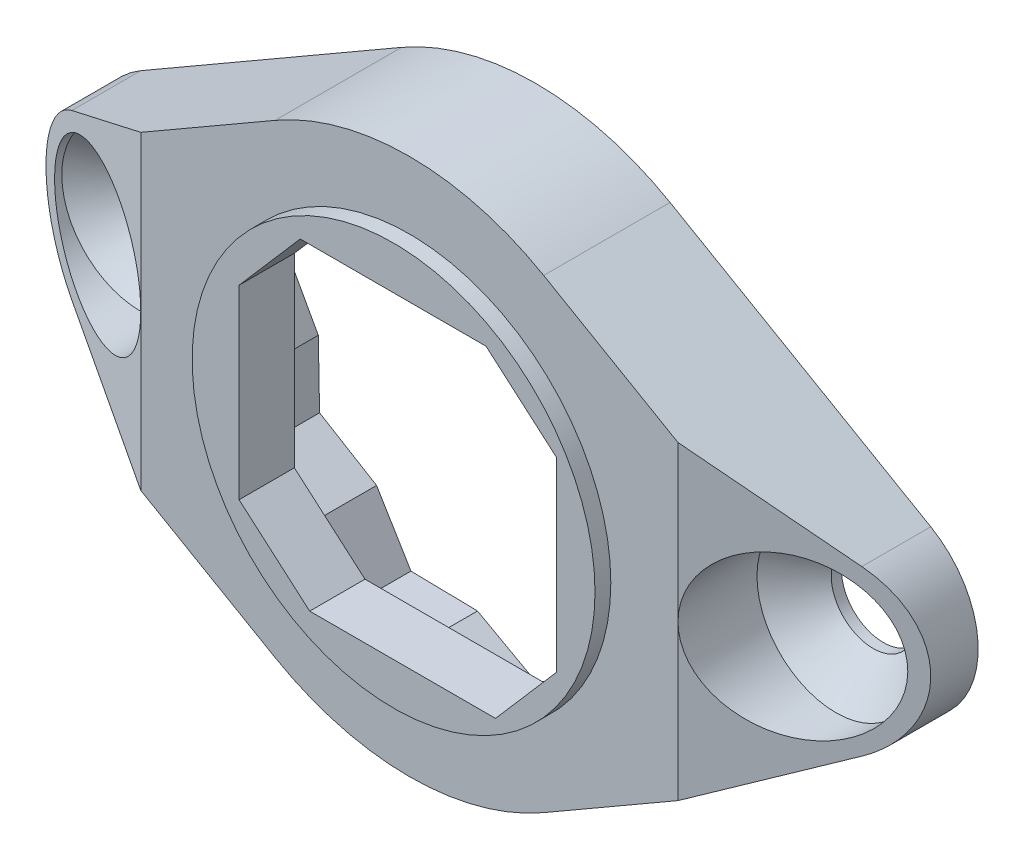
ISO-10303-21;
HEADER;
FILE_DESCRIPTION(('STEP AP214'),'2;1');
FILE_NAME('part.step','',(''),(''),'','','');
FILE_SCHEMA(('AUTOMOTIVE_DESIGN { 1 0 10303 214 1 1 1 1 }'));
ENDSEC;
DATA;
#1=APPLICATION_CONTEXT('core data for automotive mechanical design processes');
#2=APPLICATION_PROTOCOL_DEFINITION('international standard','automotive_design',2000,#1);
#3=PRODUCT_CONTEXT('',#1,'mechanical');
#4=PRODUCT('Part','Part','',(#3));
#5=PRODUCT_RELATED_PRODUCT_CATEGORY('part','',(#4));
#6=PRODUCT_DEFINITION_FORMATION('','',#4);
#7=PRODUCT_DEFINITION_CONTEXT('part definition',#1,'design');
#8=PRODUCT_DEFINITION('design','',#6,#7);
#9=PRODUCT_DEFINITION_SHAPE('','',#8);
#10=(LENGTH_UNIT() NAMED_UNIT(*) SI_UNIT(.MILLI.,.METRE.));
#11=(NAMED_UNIT(*) PLANE_ANGLE_UNIT() SI_UNIT($,.RADIAN.));
#12=(NAMED_UNIT(*) SI_UNIT($,.STERADIAN.) SOLID_ANGLE_UNIT());
#13=UNCERTAINTY_MEASURE_WITH_UNIT(LENGTH_MEASURE(1.E-05),#10,'distance_accuracy_value','');
#14=(GEOMETRIC_REPRESENTATION_CONTEXT(3) GLOBAL_UNCERTAINTY_ASSIGNED_CONTEXT((#13)) GLOBAL_UNIT_ASSIGNED_CONTEXT((#10,
#11,#12)) REPRESENTATION_CONTEXT('',''));
#15=CARTESIAN_POINT('',(0.,0.,0.));
#16=DIRECTION('',(0.,0.,1.));
#17=DIRECTION('',(1.,0.,0.));
#18=AXIS2_PLACEMENT_3D('',#15,#16,#17);
#19=CARTESIAN_POINT('',(-28.,0.,3.));
#20=DIRECTION('',(0.413802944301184,0.,-0.910366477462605));
#21=DIRECTION('',(-0.910366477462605,0.,-0.413802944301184));
#22=AXIS2_PLACEMENT_3D('',#19,#20,#21);
#23=PLANE('',#22);
#24=DIRECTION('',(0.,1.,0.));
#25=VECTOR('',#24,1.);
#26=CARTESIAN_POINT('',(-17.,0.,8.));
#27=LINE('',#26,#25);
#28=CARTESIAN_POINT('',(-17.,9.81495457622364,8.));
#29=VERTEX_POINT('',#28);
#30=CARTESIAN_POINT('',(-17.,0.,8.));
#31=VERTEX_POINT('',#30);
#32=EDGE_CURVE('E409',#29,#31,#27,.F.);
#33=ORIENTED_EDGE('',*,*,#32,.F.);
#34=DIRECTION('',(0.805837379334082,0.465250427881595,0.366289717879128));
#35=VECTOR('',#34,1.);
#36=CARTESIAN_POINT('',(-25.,5.19615242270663,4.36363636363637));
#37=LINE('',#36,#35);
#38=CARTESIAN_POINT('',(-25.,5.19615242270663,4.36363636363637));
#39=VERTEX_POINT('',#38);
#40=EDGE_CURVE('E75',#39,#29,#37,.T.);
#41=ORIENTED_EDGE('',*,*,#40,.F.);
#42=CARTESIAN_POINT('',(-22.,0.,5.72727272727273));
#43=DIRECTION('',(0.413802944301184,0.,-0.910366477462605));
#44=DIRECTION('',(0.910366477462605,0.,0.413802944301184));
#45=AXIS2_PLACEMENT_3D('',#42,#43,#44);
#46=ELLIPSE('',#45,6.5907523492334,6.);
#47=CARTESIAN_POINT('',(-25.,-5.19615242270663,4.36363636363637));
#48=VERTEX_POINT('',#47);
#49=EDGE_CURVE('E399',#48,#39,#46,.T.);
#50=ORIENTED_EDGE('',*,*,#49,.F.);
#51=DIRECTION('',(-0.805837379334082,0.465250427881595,-0.366289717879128));
#52=VECTOR('',#51,1.);
#53=CARTESIAN_POINT('',(-17.,-9.81495457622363,8.));
#54=LINE('',#53,#52);
#55=CARTESIAN_POINT('',(-17.,-9.81495457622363,8.));
#56=VERTEX_POINT('',#55);
#57=EDGE_CURVE('E659',#56,#48,#54,.T.);
#58=ORIENTED_EDGE('',*,*,#57,.F.);
#59=EDGE_CURVE('E410',#31,#56,#27,.F.);
#60=ORIENTED_EDGE('',*,*,#59,.F.);
#61=CARTESIAN_POINT('',(-22.,0.,5.72727272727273));
#62=DIRECTION('',(0.413802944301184,0.,-0.910366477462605));
#63=DIRECTION('',(-0.910366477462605,0.,-0.413802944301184));
#64=AXIS2_PLACEMENT_3D('',#61,#62,#63);
#65=ELLIPSE('',#64,5.49229362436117,5.);
#66=CARTESIAN_POINT('',(-27.,0.,3.45454545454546));
#67=VERTEX_POINT('',#66);
#68=EDGE_CURVE('E32',#67,#31,#65,.F.);
#69=ORIENTED_EDGE('',*,*,#68,.F.);
#70=EDGE_CURVE('E354',#31,#67,#65,.F.);
#71=ORIENTED_EDGE('',*,*,#70,.F.);
#72=EDGE_LOOP('',(#33,#41,#50,#58,#60,#69,#71));
#73=FACE_BOUND('',#72,.T.);
#74=ADVANCED_FACE('F15',(#73),#23,.F.);
#75=CARTESIAN_POINT('',(-22.,0.,8.));
#76=DIRECTION('',(0.,0.,-1.));
#77=DIRECTION('',(-1.,0.,0.));
#78=AXIS2_PLACEMENT_3D('',#75,#76,#77);
#79=CYLINDRICAL_SURFACE('',#78,5.);
#80=CARTESIAN_POINT('',(-22.,0.,3.));
#81=DIRECTION('',(0.,0.,-1.));
#82=DIRECTION('',(-1.,0.,0.));
#83=AXIS2_PLACEMENT_3D('',#80,#81,#82);
#84=CIRCLE('',#83,5.);
#85=CARTESIAN_POINT('',(-27.,0.,3.));
#86=VERTEX_POINT('',#85);
#87=EDGE_CURVE('E345',#86,#86,#84,.T.);
#88=ORIENTED_EDGE('',*,*,#87,.T.);
#89=EDGE_LOOP('',(#88));
#90=FACE_BOUND('',#89,.T.);
#91=ORIENTED_EDGE('',*,*,#70,.T.);
#92=ORIENTED_EDGE('',*,*,#68,.T.);
#93=EDGE_LOOP('',(#91,#92));
#94=FACE_BOUND('',#93,.T.);
#95=ADVANCED_FACE('F677',(#90,#94),#79,.F.);
#96=CARTESIAN_POINT('',(-22.,0.,3.));
#97=DIRECTION('',(0.,0.,1.));
#98=DIRECTION('',(1.,0.,0.));
#99=AXIS2_PLACEMENT_3D('',#96,#97,#98);
#100=CONICAL_SURFACE('',#99,5.,0.785398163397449);
#101=ORIENTED_EDGE('',*,*,#87,.F.);
#102=EDGE_LOOP('',(#101));
#103=FACE_BOUND('',#102,.T.);
#104=CARTESIAN_POINT('',(-22.,0.,0.65));
#105=DIRECTION('',(0.,0.,1.));
#106=DIRECTION('',(1.,0.,0.));
#107=AXIS2_PLACEMENT_3D('',#104,#105,#106);
#108=CIRCLE('',#107,2.65);
#109=CARTESIAN_POINT('',(-19.35,0.,0.65));
#110=VERTEX_POINT('',#109);
#111=EDGE_CURVE('E355',#110,#110,#108,.F.);
#112=ORIENTED_EDGE('',*,*,#111,.T.);
#113=EDGE_LOOP('',(#112));
#114=FACE_BOUND('',#113,.T.);
#115=ADVANCED_FACE('F679',(#103,#114),#100,.F.);
#116=CARTESIAN_POINT('',(-22.,0.,0.));
#117=DIRECTION('',(0.,0.,1.));
#118=DIRECTION('',(1.,0.,0.));
#119=AXIS2_PLACEMENT_3D('',#116,#117,#118);
#120=CYLINDRICAL_SURFACE('',#119,2.65);
#121=CARTESIAN_POINT('',(-22.,0.,0.));
#122=DIRECTION('',(0.,0.,1.));
#123=DIRECTION('',(1.,0.,0.));
#124=AXIS2_PLACEMENT_3D('',#121,#122,#123);
#125=CIRCLE('',#124,2.65);
#126=CARTESIAN_POINT('',(-19.35,0.,0.));
#127=VERTEX_POINT('',#126);
#128=EDGE_CURVE('E358',#127,#127,#125,.F.);
#129=ORIENTED_EDGE('',*,*,#128,.T.);
#130=EDGE_LOOP('',(#129));
#131=FACE_BOUND('',#130,.T.);
#132=ORIENTED_EDGE('',*,*,#111,.F.);
#133=EDGE_LOOP('',(#132));
#134=FACE_BOUND('',#133,.T.);
#135=ADVANCED_FACE('F687',(#131,#134),#120,.F.);
#136=CARTESIAN_POINT('',(22.,0.,8.));
#137=DIRECTION('',(0.,0.,-1.));
#138=DIRECTION('',(-1.,0.,0.));
#139=AXIS2_PLACEMENT_3D('',#136,#137,#138);
#140=CYLINDRICAL_SURFACE('',#139,5.);
#141=CARTESIAN_POINT('',(22.,0.,3.));
#142=DIRECTION('',(0.,0.,-1.));
#143=DIRECTION('',(-1.,0.,0.));
#144=AXIS2_PLACEMENT_3D('',#141,#142,#143);
#145=CIRCLE('',#144,5.);
#146=CARTESIAN_POINT('',(17.,0.,3.));
#147=VERTEX_POINT('',#146);
#148=EDGE_CURVE('E363',#147,#147,#145,.T.);
#149=ORIENTED_EDGE('',*,*,#148,.T.);
#150=EDGE_LOOP('',(#149));
#151=FACE_BOUND('',#150,.T.);
#152=CARTESIAN_POINT('',(22.,0.,5.72727272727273));
#153=DIRECTION('',(-0.413802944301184,0.,-0.910366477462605));
#154=DIRECTION('',(0.910366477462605,0.,-0.413802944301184));
#155=AXIS2_PLACEMENT_3D('',#152,#153,#154);
#156=ELLIPSE('',#155,5.49229362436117,5.);
#157=CARTESIAN_POINT('',(17.,0.,8.));
#158=VERTEX_POINT('',#157);
#159=EDGE_CURVE('E18',#158,#158,#156,.T.);
#160=ORIENTED_EDGE('',*,*,#159,.F.);
#161=EDGE_LOOP('',(#160));
#162=FACE_BOUND('',#161,.T.);
#163=ADVANCED_FACE('F694',(#151,#162),#140,.F.);
#164=CARTESIAN_POINT('',(22.,0.,3.));
#165=DIRECTION('',(0.,0.,1.));
#166=DIRECTION('',(1.,0.,0.));
#167=AXIS2_PLACEMENT_3D('',#164,#165,#166);
#168=CONICAL_SURFACE('',#167,5.,0.785398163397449);
#169=ORIENTED_EDGE('',*,*,#148,.F.);
#170=EDGE_LOOP('',(#169));
#171=FACE_BOUND('',#170,.T.);
#172=CARTESIAN_POINT('',(22.,0.,0.65));
#173=DIRECTION('',(0.,0.,1.));
#174=DIRECTION('',(1.,0.,0.));
#175=AXIS2_PLACEMENT_3D('',#172,#173,#174);
#176=CIRCLE('',#175,2.65);
#177=CARTESIAN_POINT('',(24.65,0.,0.65));
#178=VERTEX_POINT('',#177);
#179=EDGE_CURVE('E366',#178,#178,#176,.F.);
#180=ORIENTED_EDGE('',*,*,#179,.T.);
#181=EDGE_LOOP('',(#180));
#182=FACE_BOUND('',#181,.T.);
#183=ADVANCED_FACE('F698',(#171,#182),#168,.F.);
#184=CARTESIAN_POINT('',(22.,0.,0.));
#185=DIRECTION('',(0.,0.,1.));
#186=DIRECTION('',(1.,0.,0.));
#187=AXIS2_PLACEMENT_3D('',#184,#185,#186);
#188=CYLINDRICAL_SURFACE('',#187,2.65);
#189=CARTESIAN_POINT('',(22.,0.,0.));
#190=DIRECTION('',(0.,0.,1.));
#191=DIRECTION('',(1.,0.,0.));
#192=AXIS2_PLACEMENT_3D('',#189,#190,#191);
#193=CIRCLE('',#192,2.65);
#194=CARTESIAN_POINT('',(24.65,0.,0.));
#195=VERTEX_POINT('',#194);
#196=EDGE_CURVE('E371',#195,#195,#193,.F.);
#197=ORIENTED_EDGE('',*,*,#196,.T.);
#198=EDGE_LOOP('',(#197));
#199=FACE_BOUND('',#198,.T.);
#200=ORIENTED_EDGE('',*,*,#179,.F.);
#201=EDGE_LOOP('',(#200));
#202=FACE_BOUND('',#201,.T.);
#203=ADVANCED_FACE('F702',(#199,#202),#188,.F.);
#204=CARTESIAN_POINT('',(-25.,5.19615242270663,0.));
#205=DIRECTION('',(-0.5,0.866025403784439,0.));
#206=DIRECTION('',(-0.866025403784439,-0.5,0.));
#207=AXIS2_PLACEMENT_3D('',#204,#205,#206);
#208=PLANE('',#207);
#209=DIRECTION('',(-0.866025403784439,-0.5,0.));
#210=VECTOR('',#209,1.);
#211=CARTESIAN_POINT('',(-8.5,14.7224318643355,0.));
#212=LINE('',#211,#210);
#213=CARTESIAN_POINT('',(-8.5,14.7224318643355,0.));
#214=VERTEX_POINT('',#213);
#215=CARTESIAN_POINT('',(-25.,5.19615242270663,0.));
#216=VERTEX_POINT('',#215);
#217=EDGE_CURVE('E376',#214,#216,#212,.T.);
#218=ORIENTED_EDGE('',*,*,#217,.T.);
#219=DIRECTION('',(0.,0.,1.));
#220=VECTOR('',#219,1.);
#221=CARTESIAN_POINT('',(-25.,5.19615242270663,0.));
#222=LINE('',#221,#220);
#223=EDGE_CURVE('E83',#216,#39,#222,.T.);
#224=ORIENTED_EDGE('',*,*,#223,.T.);
#225=ORIENTED_EDGE('',*,*,#40,.T.);
#226=DIRECTION('',(-0.866025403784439,-0.5,0.));
#227=VECTOR('',#226,1.);
#228=CARTESIAN_POINT('',(-25.,5.19615242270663,8.));
#229=LINE('',#228,#227);
#230=CARTESIAN_POINT('',(-8.5,14.7224318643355,8.));
#231=VERTEX_POINT('',#230);
#232=EDGE_CURVE('E381',#29,#231,#229,.F.);
#233=ORIENTED_EDGE('',*,*,#232,.T.);
#234=DIRECTION('',(0.,0.,1.));
#235=VECTOR('',#234,1.);
#236=CARTESIAN_POINT('',(-8.49999999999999,14.7224318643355,0.));
#237=LINE('',#236,#235);
#238=EDGE_CURVE('E378',#231,#214,#237,.F.);
#239=ORIENTED_EDGE('',*,*,#238,.T.);
#240=EDGE_LOOP('',(#218,#224,#225,#233,#239));
#241=FACE_BOUND('',#240,.T.);
#242=ADVANCED_FACE('F666',(#241),#208,.T.);
#243=CARTESIAN_POINT('',(8.5,14.7224318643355,0.));
#244=DIRECTION('',(0.5,0.866025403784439,0.));
#245=DIRECTION('',(-0.866025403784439,0.5,0.));
#246=AXIS2_PLACEMENT_3D('',#243,#244,#245);
#247=PLANE('',#246);
#248=DIRECTION('',(0.,0.,1.));
#249=VECTOR('',#248,1.);
#250=CARTESIAN_POINT('',(8.5,14.7224318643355,0.));
#251=LINE('',#250,#249);
#252=CARTESIAN_POINT('',(8.5,14.7224318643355,8.));
#253=VERTEX_POINT('',#252);
#254=CARTESIAN_POINT('',(8.5,14.7224318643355,0.));
#255=VERTEX_POINT('',#254);
#256=EDGE_CURVE('E322',#253,#255,#251,.F.);
#257=ORIENTED_EDGE('',*,*,#256,.F.);
#258=DIRECTION('',(-0.866025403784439,0.5,0.));
#259=VECTOR('',#258,1.);
#260=CARTESIAN_POINT('',(8.5,14.7224318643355,8.));
#261=LINE('',#260,#259);
#262=CARTESIAN_POINT('',(17.,9.81495457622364,8.));
#263=VERTEX_POINT('',#262);
#264=EDGE_CURVE('E315',#253,#263,#261,.F.);
#265=ORIENTED_EDGE('',*,*,#264,.T.);
#266=CARTESIAN_POINT('',(17.,9.81495457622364,8.));
#267=CARTESIAN_POINT('',(25.,5.19615242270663,4.36363636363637));
#268=B_SPLINE_CURVE_WITH_KNOTS('',1,(#266,#267),.UNSPECIFIED.,.F.,.F.,(2,2),(0.,1.),.UNSPECIFIED.);
#269=CARTESIAN_POINT('',(25.,5.19615242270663,4.36363636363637));
#270=VERTEX_POINT('',#269);
#271=EDGE_CURVE('E319',#263,#270,#268,.T.);
#272=ORIENTED_EDGE('',*,*,#271,.T.);
#273=DIRECTION('',(0.,0.,1.));
#274=VECTOR('',#273,1.);
#275=CARTESIAN_POINT('',(25.,5.19615242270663,0.));
#276=LINE('',#275,#274);
#277=CARTESIAN_POINT('',(25.,5.19615242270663,0.));
#278=VERTEX_POINT('',#277);
#279=EDGE_CURVE('E326',#270,#278,#276,.F.);
#280=ORIENTED_EDGE('',*,*,#279,.T.);
#281=DIRECTION('',(-0.866025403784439,0.5,0.));
#282=VECTOR('',#281,1.);
#283=CARTESIAN_POINT('',(25.,5.19615242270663,0.));
#284=LINE('',#283,#282);
#285=EDGE_CURVE('E383',#278,#255,#284,.T.);
#286=ORIENTED_EDGE('',*,*,#285,.T.);
#287=EDGE_LOOP('',(#257,#265,#272,#280,#286));
#288=FACE_BOUND('',#287,.T.);
#289=ADVANCED_FACE('F317',(#288),#247,.T.);
#290=CARTESIAN_POINT('',(22.,0.,0.));
#291=DIRECTION('',(0.,0.,1.));
#292=DIRECTION('',(1.,0.,0.));
#293=AXIS2_PLACEMENT_3D('',#290,#291,#292);
#294=CYLINDRICAL_SURFACE('',#293,6.);
#295=CARTESIAN_POINT('',(22.,0.,0.));
#296=DIRECTION('',(0.,0.,1.));
#297=DIRECTION('',(1.,0.,0.));
#298=AXIS2_PLACEMENT_3D('',#295,#296,#297);
#299=CIRCLE('',#298,6.);
#300=CARTESIAN_POINT('',(25.,-5.19615242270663,0.));
#301=VERTEX_POINT('',#300);
#302=EDGE_CURVE('E325',#301,#278,#299,.T.);
#303=ORIENTED_EDGE('',*,*,#302,.T.);
#304=ORIENTED_EDGE('',*,*,#279,.F.);
#305=CARTESIAN_POINT('',(22.,0.,5.72727272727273));
#306=DIRECTION('',(-0.413802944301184,0.,-0.910366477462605));
#307=DIRECTION('',(-0.910366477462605,0.,0.413802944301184));
#308=AXIS2_PLACEMENT_3D('',#305,#306,#307);
#309=ELLIPSE('',#308,6.5907523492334,6.);
#310=CARTESIAN_POINT('',(25.,-5.19615242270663,4.36363636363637));
#311=VERTEX_POINT('',#310);
#312=EDGE_CURVE('E24',#270,#311,#309,.T.);
#313=ORIENTED_EDGE('',*,*,#312,.T.);
#314=DIRECTION('',(0.,0.,1.));
#315=VECTOR('',#314,1.);
#316=CARTESIAN_POINT('',(25.,-5.19615242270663,0.));
#317=LINE('',#316,#315);
#318=EDGE_CURVE('E46',#311,#301,#317,.F.);
#319=ORIENTED_EDGE('',*,*,#318,.T.);
#320=EDGE_LOOP('',(#303,#304,#313,#319));
#321=FACE_BOUND('',#320,.T.);
#322=ADVANCED_FACE('F711',(#321),#294,.T.);
#323=CARTESIAN_POINT('',(25.,-5.19615242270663,0.));
#324=DIRECTION('',(0.5,-0.866025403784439,0.));
#325=DIRECTION('',(0.866025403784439,0.5,0.));
#326=AXIS2_PLACEMENT_3D('',#323,#324,#325);
#327=PLANE('',#326);
#328=DIRECTION('',(0.866025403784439,0.5,0.));
#329=VECTOR('',#328,1.);
#330=CARTESIAN_POINT('',(8.5,-14.7224318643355,0.));
#331=LINE('',#330,#329);
#332=CARTESIAN_POINT('',(8.5,-14.7224318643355,0.));
#333=VERTEX_POINT('',#332);
#334=EDGE_CURVE('E387',#333,#301,#331,.T.);
#335=ORIENTED_EDGE('',*,*,#334,.T.);
#336=ORIENTED_EDGE('',*,*,#318,.F.);
#337=CARTESIAN_POINT('',(25.,-5.19615242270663,4.36363636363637));
#338=CARTESIAN_POINT('',(17.,-9.81495457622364,8.));
#339=B_SPLINE_CURVE_WITH_KNOTS('',1,(#337,#338),.UNSPECIFIED.,.F.,.F.,(2,2),(0.,1.),.UNSPECIFIED.);
#340=CARTESIAN_POINT('',(17.,-9.81495457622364,8.));
#341=VERTEX_POINT('',#340);
#342=EDGE_CURVE('E10',#311,#341,#339,.T.);
#343=ORIENTED_EDGE('',*,*,#342,.T.);
#344=DIRECTION('',(0.866025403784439,0.5,0.));
#345=VECTOR('',#344,1.);
#346=CARTESIAN_POINT('',(25.,-5.19615242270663,8.));
#347=LINE('',#346,#345);
#348=CARTESIAN_POINT('',(8.5,-14.7224318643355,8.));
#349=VERTEX_POINT('',#348);
#350=EDGE_CURVE('E54',#341,#349,#347,.F.);
#351=ORIENTED_EDGE('',*,*,#350,.T.);
#352=DIRECTION('',(0.,0.,1.));
#353=VECTOR('',#352,1.);
#354=CARTESIAN_POINT('',(8.5,-14.7224318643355,0.));
#355=LINE('',#354,#353);
#356=EDGE_CURVE('E389',#349,#333,#355,.F.);
#357=ORIENTED_EDGE('',*,*,#356,.T.);
#358=EDGE_LOOP('',(#335,#336,#343,#351,#357));
#359=FACE_BOUND('',#358,.T.);
#360=ADVANCED_FACE('F714',(#359),#327,.T.);
#361=CARTESIAN_POINT('',(-8.49999999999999,-14.7224318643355,0.));
#362=DIRECTION('',(-0.5,-0.866025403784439,0.));
#363=DIRECTION('',(0.866025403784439,-0.5,0.));
#364=AXIS2_PLACEMENT_3D('',#361,#362,#363);
#365=PLANE('',#364);
#366=DIRECTION('',(0.,0.,1.));
#367=VECTOR('',#366,1.);
#368=CARTESIAN_POINT('',(-8.49999999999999,-14.7224318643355,0.));
#369=LINE('',#368,#367);
#370=CARTESIAN_POINT('',(-8.49999999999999,-14.7224318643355,8.));
#371=VERTEX_POINT('',#370);
#372=CARTESIAN_POINT('',(-8.49999999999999,-14.7224318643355,0.));
#373=VERTEX_POINT('',#372);
#374=EDGE_CURVE('E391',#371,#373,#369,.F.);
#375=ORIENTED_EDGE('',*,*,#374,.F.);
#376=DIRECTION('',(0.866025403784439,-0.5,0.));
#377=VECTOR('',#376,1.);
#378=CARTESIAN_POINT('',(-8.49999999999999,-14.7224318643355,8.));
#379=LINE('',#378,#377);
#380=EDGE_CURVE('E400',#371,#56,#379,.F.);
#381=ORIENTED_EDGE('',*,*,#380,.T.);
#382=ORIENTED_EDGE('',*,*,#57,.T.);
#383=DIRECTION('',(0.,0.,1.));
#384=VECTOR('',#383,1.);
#385=CARTESIAN_POINT('',(-25.,-5.19615242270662,0.));
#386=LINE('',#385,#384);
#387=CARTESIAN_POINT('',(-25.,-5.19615242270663,0.));
#388=VERTEX_POINT('',#387);
#389=EDGE_CURVE('E396',#48,#388,#386,.F.);
#390=ORIENTED_EDGE('',*,*,#389,.T.);
#391=DIRECTION('',(0.866025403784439,-0.5,0.));
#392=VECTOR('',#391,1.);
#393=CARTESIAN_POINT('',(-25.,-5.19615242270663,0.));
#394=LINE('',#393,#392);
#395=EDGE_CURVE('E393',#388,#373,#394,.T.);
#396=ORIENTED_EDGE('',*,*,#395,.T.);
#397=EDGE_LOOP('',(#375,#381,#382,#390,#396));
#398=FACE_BOUND('',#397,.T.);
#399=ADVANCED_FACE('F675',(#398),#365,.T.);
#400=CARTESIAN_POINT('',(-22.,0.,0.));
#401=DIRECTION('',(0.,0.,1.));
#402=DIRECTION('',(1.,0.,0.));
#403=AXIS2_PLACEMENT_3D('',#400,#401,#402);
#404=CYLINDRICAL_SURFACE('',#403,6.);
#405=CARTESIAN_POINT('',(-22.,0.,0.));
#406=DIRECTION('',(0.,0.,1.));
#407=DIRECTION('',(1.,0.,0.));
#408=AXIS2_PLACEMENT_3D('',#405,#406,#407);
#409=CIRCLE('',#408,6.);
#410=EDGE_CURVE('E397',#216,#388,#409,.T.);
#411=ORIENTED_EDGE('',*,*,#410,.T.);
#412=ORIENTED_EDGE('',*,*,#389,.F.);
#413=ORIENTED_EDGE('',*,*,#49,.T.);
#414=ORIENTED_EDGE('',*,*,#223,.F.);
#415=EDGE_LOOP('',(#411,#412,#413,#414));
#416=FACE_BOUND('',#415,.T.);
#417=ADVANCED_FACE('F670',(#416),#404,.T.);
#418=CARTESIAN_POINT('',(0.,0.,8.));
#419=DIRECTION('',(0.,0.,1.));
#420=DIRECTION('',(1.,0.,0.));
#421=AXIS2_PLACEMENT_3D('',#418,#419,#420);
#422=PLANE('',#421);
#423=CARTESIAN_POINT('',(0.,0.,8.));
#424=DIRECTION('',(0.,0.,1.));
#425=DIRECTION('',(1.,0.,0.));
#426=AXIS2_PLACEMENT_3D('',#423,#424,#425);
#427=CIRCLE('',#426,12.75);
#428=CARTESIAN_POINT('',(12.75,0.,8.));
#429=VERTEX_POINT('',#428);
#430=EDGE_CURVE('E401',#429,#429,#427,.F.);
#431=ORIENTED_EDGE('',*,*,#430,.T.);
#432=EDGE_LOOP('',(#431));
#433=FACE_BOUND('',#432,.T.);
#434=CARTESIAN_POINT('',(0.,0.,8.));
#435=DIRECTION('',(0.,0.,1.));
#436=DIRECTION('',(1.,0.,0.));
#437=AXIS2_PLACEMENT_3D('',#434,#435,#436);
#438=CIRCLE('',#437,17.);
#439=EDGE_CURVE('E404',#231,#253,#438,.F.);
#440=ORIENTED_EDGE('',*,*,#439,.F.);
#441=ORIENTED_EDGE('',*,*,#232,.F.);
#442=ORIENTED_EDGE('',*,*,#32,.T.);
#443=ORIENTED_EDGE('',*,*,#59,.T.);
#444=ORIENTED_EDGE('',*,*,#380,.F.);
#445=CARTESIAN_POINT('',(0.,0.,8.));
#446=DIRECTION('',(0.,0.,1.));
#447=DIRECTION('',(1.,0.,0.));
#448=AXIS2_PLACEMENT_3D('',#445,#446,#447);
#449=CIRCLE('',#448,17.);
#450=EDGE_CURVE('E406',#349,#371,#449,.F.);
#451=ORIENTED_EDGE('',*,*,#450,.F.);
#452=ORIENTED_EDGE('',*,*,#350,.F.);
#453=CARTESIAN_POINT('',(17.,-9.81495457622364,8.));
#454=CARTESIAN_POINT('',(17.,9.81495457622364,8.));
#455=B_SPLINE_CURVE_WITH_KNOTS('',1,(#453,#454),.UNSPECIFIED.,.F.,.F.,(2,2),(0.,1.),.UNSPECIFIED.);
#456=EDGE_CURVE('E330',#341,#158,#455,.T.);
#457=ORIENTED_EDGE('',*,*,#456,.T.);
#458=EDGE_CURVE('E328',#158,#263,#455,.T.);
#459=ORIENTED_EDGE('',*,*,#458,.T.);
#460=ORIENTED_EDGE('',*,*,#264,.F.);
#461=EDGE_LOOP('',(#440,#441,#442,#443,#444,#451,#452,#457,#459,#460));
#462=FACE_BOUND('',#461,.T.);
#463=ADVANCED_FACE('F329',(#433,#462),#422,.T.);
#464=CARTESIAN_POINT('',(0.,0.,8.));
#465=DIRECTION('',(0.,0.,1.));
#466=DIRECTION('',(1.,0.,0.));
#467=AXIS2_PLACEMENT_3D('',#464,#465,#466);
#468=CYLINDRICAL_SURFACE('',#467,12.75);
#469=ORIENTED_EDGE('',*,*,#430,.F.);
#470=EDGE_LOOP('',(#469));
#471=FACE_BOUND('',#470,.T.);
#472=CARTESIAN_POINT('',(0.,0.,9.));
#473=DIRECTION('',(0.,0.,1.));
#474=DIRECTION('',(1.,0.,0.));
#475=AXIS2_PLACEMENT_3D('',#472,#473,#474);
#476=CIRCLE('',#475,12.75);
#477=CARTESIAN_POINT('',(12.75,0.,9.));
#478=VERTEX_POINT('',#477);
#479=EDGE_CURVE('E413',#478,#478,#476,.F.);
#480=ORIENTED_EDGE('',*,*,#479,.T.);
#481=EDGE_LOOP('',(#480));
#482=FACE_BOUND('',#481,.T.);
#483=ADVANCED_FACE('F724',(#471,#482),#468,.T.);
#484=CARTESIAN_POINT('',(0.,0.,0.));
#485=DIRECTION('',(0.,0.,1.));
#486=DIRECTION('',(1.,0.,0.));
#487=AXIS2_PLACEMENT_3D('',#484,#485,#486);
#488=CYLINDRICAL_SURFACE('',#487,17.);
#489=CARTESIAN_POINT('',(0.,0.,0.));
#490=DIRECTION('',(0.,0.,1.));
#491=DIRECTION('',(1.,0.,0.));
#492=AXIS2_PLACEMENT_3D('',#489,#490,#491);
#493=CIRCLE('',#492,17.);
#494=EDGE_CURVE('E416',#255,#214,#493,.T.);
#495=ORIENTED_EDGE('',*,*,#494,.T.);
#496=ORIENTED_EDGE('',*,*,#238,.F.);
#497=ORIENTED_EDGE('',*,*,#439,.T.);
#498=ORIENTED_EDGE('',*,*,#256,.T.);
#499=EDGE_LOOP('',(#495,#496,#497,#498));
#500=FACE_BOUND('',#499,.T.);
#501=ADVANCED_FACE('F728',(#500),#488,.T.);
#502=CARTESIAN_POINT('',(0.,0.,0.));
#503=DIRECTION('',(0.,0.,1.));
#504=DIRECTION('',(1.,0.,0.));
#505=AXIS2_PLACEMENT_3D('',#502,#503,#504);
#506=CYLINDRICAL_SURFACE('',#505,17.);
#507=CARTESIAN_POINT('',(0.,0.,0.));
#508=DIRECTION('',(0.,0.,1.));
#509=DIRECTION('',(1.,0.,0.));
#510=AXIS2_PLACEMENT_3D('',#507,#508,#509);
#511=CIRCLE('',#510,17.);
#512=EDGE_CURVE('E419',#373,#333,#511,.T.);
#513=ORIENTED_EDGE('',*,*,#512,.T.);
#514=ORIENTED_EDGE('',*,*,#356,.F.);
#515=ORIENTED_EDGE('',*,*,#450,.T.);
#516=ORIENTED_EDGE('',*,*,#374,.T.);
#517=EDGE_LOOP('',(#513,#514,#515,#516));
#518=FACE_BOUND('',#517,.T.);
#519=ADVANCED_FACE('F732',(#518),#506,.T.);
#520=CARTESIAN_POINT('',(0.,0.,0.));
#521=DIRECTION('',(0.,0.,1.));
#522=DIRECTION('',(1.,0.,0.));
#523=AXIS2_PLACEMENT_3D('',#520,#521,#522);
#524=PLANE('',#523);
#525=ORIENTED_EDGE('',*,*,#128,.F.);
#526=EDGE_LOOP('',(#525));
#527=FACE_BOUND('',#526,.T.);
#528=ORIENTED_EDGE('',*,*,#196,.F.);
#529=EDGE_LOOP('',(#528));
#530=FACE_BOUND('',#529,.T.);
#531=DIRECTION('',(0.875507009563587,-0.483205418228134,0.));
#532=VECTOR('',#531,1.);
#533=CARTESIAN_POINT('',(0.,15.8,0.));
#534=LINE('',#533,#532);
#535=CARTESIAN_POINT('',(0.,15.8,0.));
#536=VERTEX_POINT('',#535);
#537=CARTESIAN_POINT('',(3.68817139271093,13.7644430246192,0.));
#538=VERTEX_POINT('',#537);
#539=EDGE_CURVE('E422',#536,#538,#534,.T.);
#540=ORIENTED_EDGE('',*,*,#539,.F.);
#541=DIRECTION('',(0.875507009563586,0.483205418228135,0.));
#542=VECTOR('',#541,1.);
#543=CARTESIAN_POINT('',(-3.68817139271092,13.7644430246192,0.));
#544=LINE('',#543,#542);
#545=CARTESIAN_POINT('',(-3.68817139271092,13.7644430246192,0.));
#546=VERTEX_POINT('',#545);
#547=EDGE_CURVE('E468',#546,#536,#544,.T.);
#548=ORIENTED_EDGE('',*,*,#547,.F.);
#549=DIRECTION('',(0.999814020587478,0.0192853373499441,0.));
#550=VECTOR('',#549,1.);
#551=CARTESIAN_POINT('',(-7.9,13.6832013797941,0.));
#552=LINE('',#551,#550);
#553=CARTESIAN_POINT('',(-7.9,13.6832013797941,0.));
#554=VERTEX_POINT('',#553);
#555=EDGE_CURVE('E466',#554,#546,#552,.T.);
#556=ORIENTED_EDGE('',*,*,#555,.F.);
#557=DIRECTION('',(0.516608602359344,0.856221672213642,0.));
#558=VECTOR('',#557,1.);
#559=CARTESIAN_POINT('',(-10.0762716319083,10.0762716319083,0.));
#560=LINE('',#559,#558);
#561=CARTESIAN_POINT('',(-10.0762716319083,10.0762716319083,0.));
#562=VERTEX_POINT('',#561);
#563=EDGE_CURVE('E464',#562,#554,#560,.T.);
#564=ORIENTED_EDGE('',*,*,#563,.F.);
#565=DIRECTION('',(0.856221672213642,0.516608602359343,0.));
#566=VECTOR('',#565,1.);
#567=CARTESIAN_POINT('',(-13.6832013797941,7.9,0.));
#568=LINE('',#567,#566);
#569=CARTESIAN_POINT('',(-13.6832013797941,7.9,0.));
#570=VERTEX_POINT('',#569);
#571=EDGE_CURVE('E462',#570,#562,#568,.T.);
#572=ORIENTED_EDGE('',*,*,#571,.F.);
#573=DIRECTION('',(0.0192853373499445,0.999814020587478,0.));
#574=VECTOR('',#573,1.);
#575=CARTESIAN_POINT('',(-13.7644430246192,3.68817139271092,0.));
#576=LINE('',#575,#574);
#577=CARTESIAN_POINT('',(-13.7644430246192,3.68817139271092,0.));
#578=VERTEX_POINT('',#577);
#579=EDGE_CURVE('E460',#578,#570,#576,.T.);
#580=ORIENTED_EDGE('',*,*,#579,.F.);
#581=DIRECTION('',(0.483205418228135,0.875507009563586,0.));
#582=VECTOR('',#581,1.);
#583=CARTESIAN_POINT('',(-15.8,0.,0.));
#584=LINE('',#583,#582);
#585=CARTESIAN_POINT('',(-15.8,0.,0.));
#586=VERTEX_POINT('',#585);
#587=EDGE_CURVE('E458',#586,#578,#584,.T.);
#588=ORIENTED_EDGE('',*,*,#587,.F.);
#589=DIRECTION('',(-0.483205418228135,0.875507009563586,0.));
#590=VECTOR('',#589,1.);
#591=CARTESIAN_POINT('',(-13.7644430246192,-3.68817139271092,0.));
#592=LINE('',#591,#590);
#593=CARTESIAN_POINT('',(-13.7644430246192,-3.68817139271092,0.));
#594=VERTEX_POINT('',#593);
#595=EDGE_CURVE('E456',#594,#586,#592,.T.);
#596=ORIENTED_EDGE('',*,*,#595,.F.);
#597=DIRECTION('',(-0.0192853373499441,0.999814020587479,0.));
#598=VECTOR('',#597,1.);
#599=CARTESIAN_POINT('',(-13.6832013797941,-7.9,0.));
#600=LINE('',#599,#598);
#601=CARTESIAN_POINT('',(-13.6832013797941,-7.9,0.));
#602=VERTEX_POINT('',#601);
#603=EDGE_CURVE('E454',#602,#594,#600,.T.);
#604=ORIENTED_EDGE('',*,*,#603,.F.);
#605=DIRECTION('',(-0.856221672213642,0.516608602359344,0.));
#606=VECTOR('',#605,1.);
#607=CARTESIAN_POINT('',(-10.0762716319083,-10.0762716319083,0.));
#608=LINE('',#607,#606);
#609=CARTESIAN_POINT('',(-10.0762716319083,-10.0762716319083,0.));
#610=VERTEX_POINT('',#609);
#611=EDGE_CURVE('E452',#610,#602,#608,.T.);
#612=ORIENTED_EDGE('',*,*,#611,.F.);
#613=DIRECTION('',(-0.516608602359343,0.856221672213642,0.));
#614=VECTOR('',#613,1.);
#615=CARTESIAN_POINT('',(-7.90000000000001,-13.6832013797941,0.));
#616=LINE('',#615,#614);
#617=CARTESIAN_POINT('',(-7.90000000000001,-13.6832013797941,0.));
#618=VERTEX_POINT('',#617);
#619=EDGE_CURVE('E450',#618,#610,#616,.T.);
#620=ORIENTED_EDGE('',*,*,#619,.F.);
#621=DIRECTION('',(-0.999814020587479,0.0192853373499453,0.));
#622=VECTOR('',#621,1.);
#623=CARTESIAN_POINT('',(-3.68817139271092,-13.7644430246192,0.));
#624=LINE('',#623,#622);
#625=CARTESIAN_POINT('',(-3.68817139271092,-13.7644430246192,0.));
#626=VERTEX_POINT('',#625);
#627=EDGE_CURVE('E448',#626,#618,#624,.T.);
#628=ORIENTED_EDGE('',*,*,#627,.F.);
#629=DIRECTION('',(-0.875507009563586,0.483205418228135,0.));
#630=VECTOR('',#629,1.);
#631=CARTESIAN_POINT('',(0.,-15.8,0.));
#632=LINE('',#631,#630);
#633=CARTESIAN_POINT('',(0.,-15.8,0.));
#634=VERTEX_POINT('',#633);
#635=EDGE_CURVE('E446',#634,#626,#632,.T.);
#636=ORIENTED_EDGE('',*,*,#635,.F.);
#637=DIRECTION('',(-0.875507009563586,-0.483205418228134,0.));
#638=VECTOR('',#637,1.);
#639=CARTESIAN_POINT('',(3.68817139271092,-13.7644430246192,0.));
#640=LINE('',#639,#638);
#641=CARTESIAN_POINT('',(3.68817139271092,-13.7644430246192,0.));
#642=VERTEX_POINT('',#641);
#643=EDGE_CURVE('E444',#642,#634,#640,.T.);
#644=ORIENTED_EDGE('',*,*,#643,.F.);
#645=DIRECTION('',(-0.999814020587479,-0.0192853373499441,0.));
#646=VECTOR('',#645,1.);
#647=CARTESIAN_POINT('',(7.9,-13.6832013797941,0.));
#648=LINE('',#647,#646);
#649=CARTESIAN_POINT('',(7.9,-13.6832013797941,0.));
#650=VERTEX_POINT('',#649);
#651=EDGE_CURVE('E442',#650,#642,#648,.T.);
#652=ORIENTED_EDGE('',*,*,#651,.F.);
#653=DIRECTION('',(-0.516608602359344,-0.856221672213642,0.));
#654=VECTOR('',#653,1.);
#655=CARTESIAN_POINT('',(10.0762716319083,-10.0762716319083,0.));
#656=LINE('',#655,#654);
#657=CARTESIAN_POINT('',(10.0762716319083,-10.0762716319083,0.));
#658=VERTEX_POINT('',#657);
#659=EDGE_CURVE('E440',#658,#650,#656,.T.);
#660=ORIENTED_EDGE('',*,*,#659,.F.);
#661=DIRECTION('',(-0.856221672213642,-0.516608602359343,0.));
#662=VECTOR('',#661,1.);
#663=CARTESIAN_POINT('',(13.6832013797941,-7.90000000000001,0.));
#664=LINE('',#663,#662);
#665=CARTESIAN_POINT('',(13.6832013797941,-7.90000000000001,0.));
#666=VERTEX_POINT('',#665);
#667=EDGE_CURVE('E438',#666,#658,#664,.T.);
#668=ORIENTED_EDGE('',*,*,#667,.F.);
#669=DIRECTION('',(-0.0192853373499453,-0.999814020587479,0.));
#670=VECTOR('',#669,1.);
#671=CARTESIAN_POINT('',(13.7644430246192,-3.68817139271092,0.));
#672=LINE('',#671,#670);
#673=CARTESIAN_POINT('',(13.7644430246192,-3.68817139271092,0.));
#674=VERTEX_POINT('',#673);
#675=EDGE_CURVE('E436',#674,#666,#672,.T.);
#676=ORIENTED_EDGE('',*,*,#675,.F.);
#677=DIRECTION('',(-0.483205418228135,-0.875507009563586,0.));
#678=VECTOR('',#677,1.);
#679=CARTESIAN_POINT('',(15.8,0.,0.));
#680=LINE('',#679,#678);
#681=CARTESIAN_POINT('',(15.8,0.,0.));
#682=VERTEX_POINT('',#681);
#683=EDGE_CURVE('E434',#682,#674,#680,.T.);
#684=ORIENTED_EDGE('',*,*,#683,.F.);
#685=DIRECTION('',(0.483205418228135,-0.875507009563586,0.));
#686=VECTOR('',#685,1.);
#687=CARTESIAN_POINT('',(13.7644430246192,3.68817139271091,0.));
#688=LINE('',#687,#686);
#689=CARTESIAN_POINT('',(13.7644430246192,3.68817139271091,0.));
#690=VERTEX_POINT('',#689);
#691=EDGE_CURVE('E432',#690,#682,#688,.T.);
#692=ORIENTED_EDGE('',*,*,#691,.F.);
#693=DIRECTION('',(0.0192853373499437,-0.999814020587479,0.));
#694=VECTOR('',#693,1.);
#695=CARTESIAN_POINT('',(13.6832013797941,7.89999999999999,0.));
#696=LINE('',#695,#694);
#697=CARTESIAN_POINT('',(13.6832013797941,7.89999999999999,0.));
#698=VERTEX_POINT('',#697);
#699=EDGE_CURVE('E430',#698,#690,#696,.T.);
#700=ORIENTED_EDGE('',*,*,#699,.F.);
#701=DIRECTION('',(0.856221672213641,-0.516608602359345,0.));
#702=VECTOR('',#701,1.);
#703=CARTESIAN_POINT('',(10.0762716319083,10.0762716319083,0.));
#704=LINE('',#703,#702);
#705=CARTESIAN_POINT('',(10.0762716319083,10.0762716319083,0.));
#706=VERTEX_POINT('',#705);
#707=EDGE_CURVE('E428',#706,#698,#704,.T.);
#708=ORIENTED_EDGE('',*,*,#707,.F.);
#709=DIRECTION('',(0.516608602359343,-0.856221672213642,0.));
#710=VECTOR('',#709,1.);
#711=CARTESIAN_POINT('',(7.90000000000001,13.6832013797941,0.));
#712=LINE('',#711,#710);
#713=CARTESIAN_POINT('',(7.90000000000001,13.6832013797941,0.));
#714=VERTEX_POINT('',#713);
#715=EDGE_CURVE('E426',#714,#706,#712,.T.);
#716=ORIENTED_EDGE('',*,*,#715,.F.);
#717=DIRECTION('',(0.999814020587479,-0.0192853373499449,0.));
#718=VECTOR('',#717,1.);
#719=CARTESIAN_POINT('',(3.68817139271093,13.7644430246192,0.));
#720=LINE('',#719,#718);
#721=EDGE_CURVE('E424',#538,#714,#720,.T.);
#722=ORIENTED_EDGE('',*,*,#721,.F.);
#723=EDGE_LOOP('',(#540,#548,#556,#564,#572,#580,#588,#596,#604,#612,#620,#628,#636,#644,#652,
#660,#668,#676,#684,#692,#700,#708,#716,#722));
#724=FACE_BOUND('',#723,.T.);
#725=ORIENTED_EDGE('',*,*,#494,.F.);
#726=ORIENTED_EDGE('',*,*,#285,.F.);
#727=ORIENTED_EDGE('',*,*,#302,.F.);
#728=ORIENTED_EDGE('',*,*,#334,.F.);
#729=ORIENTED_EDGE('',*,*,#512,.F.);
#730=ORIENTED_EDGE('',*,*,#395,.F.);
#731=ORIENTED_EDGE('',*,*,#410,.F.);
#732=ORIENTED_EDGE('',*,*,#217,.F.);
#733=EDGE_LOOP('',(#725,#726,#727,#728,#729,#730,#731,#732));
#734=FACE_BOUND('',#733,.T.);
#735=ADVANCED_FACE('F736',(#527,#530,#724,#734),#524,.F.);
#736=CARTESIAN_POINT('',(0.,0.,9.));
#737=DIRECTION('',(0.,0.,-1.));
#738=DIRECTION('',(-1.,0.,0.));
#739=AXIS2_PLACEMENT_3D('',#736,#737,#738);
#740=PLANE('',#739);
#741=DIRECTION('',(0.,1.,0.));
#742=VECTOR('',#741,1.);
#743=CARTESIAN_POINT('',(10.3207600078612,6.14675866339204,9.));
#744=LINE('',#743,#742);
#745=CARTESIAN_POINT('',(10.3207600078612,6.14675866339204,9.));
#746=VERTEX_POINT('',#745);
#747=CARTESIAN_POINT('',(10.3207600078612,-5.61201505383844,9.));
#748=VERTEX_POINT('',#747);
#749=EDGE_CURVE('E471',#746,#748,#744,.F.);
#750=ORIENTED_EDGE('',*,*,#749,.T.);
#751=DIRECTION('',(0.654612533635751,0.755964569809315,0.));
#752=VECTOR('',#751,1.);
#753=CARTESIAN_POINT('',(10.3207600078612,-5.61201505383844,9.));
#754=LINE('',#753,#752);
#755=CARTESIAN_POINT('',(6.44981154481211,-10.0822928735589,9.));
#756=VERTEX_POINT('',#755);
#757=EDGE_CURVE('E486',#748,#756,#754,.F.);
#758=ORIENTED_EDGE('',*,*,#757,.T.);
#759=DIRECTION('',(1.,0.,0.));
#760=VECTOR('',#759,1.);
#761=CARTESIAN_POINT('',(6.44981154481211,-10.0822928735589,9.));
#762=LINE('',#761,#760);
#763=CARTESIAN_POINT('',(-5.30896217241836,-10.0822928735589,9.));
#764=VERTEX_POINT('',#763);
#765=EDGE_CURVE('E484',#756,#764,#762,.F.);
#766=ORIENTED_EDGE('',*,*,#765,.T.);
#767=DIRECTION('',(0.755964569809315,-0.654612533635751,0.));
#768=VECTOR('',#767,1.);
#769=CARTESIAN_POINT('',(-5.30896217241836,-10.0822928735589,9.));
#770=LINE('',#769,#768);
#771=CARTESIAN_POINT('',(-9.77923999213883,-6.21134441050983,9.));
#772=VERTEX_POINT('',#771);
#773=EDGE_CURVE('E482',#764,#772,#770,.F.);
#774=ORIENTED_EDGE('',*,*,#773,.T.);
#775=DIRECTION('',(0.,1.,0.));
#776=VECTOR('',#775,1.);
#777=CARTESIAN_POINT('',(-9.77923999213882,-6.21134441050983,9.));
#778=LINE('',#777,#776);
#779=CARTESIAN_POINT('',(-9.77923999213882,5.54742930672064,9.));
#780=VERTEX_POINT('',#779);
#781=EDGE_CURVE('E480',#772,#780,#778,.T.);
#782=ORIENTED_EDGE('',*,*,#781,.T.);
#783=DIRECTION('',(-0.654612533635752,-0.755964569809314,0.));
#784=VECTOR('',#783,1.);
#785=CARTESIAN_POINT('',(-9.77923999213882,5.54742930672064,9.));
#786=LINE('',#785,#784);
#787=CARTESIAN_POINT('',(-5.90829152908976,10.0177071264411,9.));
#788=VERTEX_POINT('',#787);
#789=EDGE_CURVE('E478',#780,#788,#786,.F.);
#790=ORIENTED_EDGE('',*,*,#789,.T.);
#791=DIRECTION('',(1.,0.,0.));
#792=VECTOR('',#791,1.);
#793=CARTESIAN_POINT('',(-5.90829152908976,10.0177071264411,9.));
#794=LINE('',#793,#792);
#795=CARTESIAN_POINT('',(5.85048218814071,10.0177071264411,9.));
#796=VERTEX_POINT('',#795);
#797=EDGE_CURVE('E476',#788,#796,#794,.T.);
#798=ORIENTED_EDGE('',*,*,#797,.T.);
#799=DIRECTION('',(-0.755964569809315,0.654612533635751,0.));
#800=VECTOR('',#799,1.);
#801=CARTESIAN_POINT('',(5.85048218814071,10.0177071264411,9.));
#802=LINE('',#801,#800);
#803=EDGE_CURVE('E473',#796,#746,#802,.F.);
#804=ORIENTED_EDGE('',*,*,#803,.T.);
#805=EDGE_LOOP('',(#750,#758,#766,#774,#782,#790,#798,#804));
#806=FACE_BOUND('',#805,.T.);
#807=ORIENTED_EDGE('',*,*,#479,.F.);
#808=EDGE_LOOP('',(#807));
#809=FACE_BOUND('',#808,.T.);
#810=ADVANCED_FACE('F740',(#806,#809),#740,.F.);
#811=CARTESIAN_POINT('',(0.,15.8,0.));
#812=DIRECTION('',(0.483205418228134,0.875507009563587,0.));
#813=DIRECTION('',(-0.875507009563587,0.483205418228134,0.));
#814=AXIS2_PLACEMENT_3D('',#811,#812,#813);
#815=PLANE('',#814);
#816=DIRECTION('',(0.,0.,1.));
#817=VECTOR('',#816,1.);
#818=CARTESIAN_POINT('',(0.,15.8,0.));
#819=LINE('',#818,#817);
#820=CARTESIAN_POINT('',(0.,15.8,5.5));
#821=VERTEX_POINT('',#820);
#822=EDGE_CURVE('E488',#536,#821,#819,.T.);
#823=ORIENTED_EDGE('',*,*,#822,.F.);
#824=ORIENTED_EDGE('',*,*,#539,.T.);
#825=DIRECTION('',(0.,0.,1.));
#826=VECTOR('',#825,1.);
#827=CARTESIAN_POINT('',(3.68817139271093,13.7644430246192,0.));
#828=LINE('',#827,#826);
#829=CARTESIAN_POINT('',(3.68817139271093,13.7644430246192,5.5));
#830=VERTEX_POINT('',#829);
#831=EDGE_CURVE('E493',#538,#830,#828,.T.);
#832=ORIENTED_EDGE('',*,*,#831,.T.);
#833=DIRECTION('',(-0.875507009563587,0.483205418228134,0.));
#834=VECTOR('',#833,1.);
#835=CARTESIAN_POINT('',(0.,15.8,5.5));
#836=LINE('',#835,#834);
#837=EDGE_CURVE('E490',#821,#830,#836,.F.);
#838=ORIENTED_EDGE('',*,*,#837,.F.);
#839=EDGE_LOOP('',(#823,#824,#832,#838));
#840=FACE_BOUND('',#839,.T.);
#841=ADVANCED_FACE('F744',(#840),#815,.F.);
#842=CARTESIAN_POINT('',(3.68817139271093,13.7644430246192,0.));
#843=DIRECTION('',(0.019285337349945,0.999814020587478,0.));
#844=DIRECTION('',(-0.999814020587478,0.019285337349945,0.));
#845=AXIS2_PLACEMENT_3D('',#842,#843,#844);
#846=PLANE('',#845);
#847=ORIENTED_EDGE('',*,*,#831,.F.);
#848=ORIENTED_EDGE('',*,*,#721,.T.);
#849=DIRECTION('',(0.,0.,1.));
#850=VECTOR('',#849,1.);
#851=CARTESIAN_POINT('',(7.90000000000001,13.6832013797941,0.));
#852=LINE('',#851,#850);
#853=CARTESIAN_POINT('',(7.90000000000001,13.6832013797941,5.5));
#854=VERTEX_POINT('',#853);
#855=EDGE_CURVE('E498',#854,#714,#852,.F.);
#856=ORIENTED_EDGE('',*,*,#855,.F.);
#857=DIRECTION('',(-0.999814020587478,0.019285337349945,0.));
#858=VECTOR('',#857,1.);
#859=CARTESIAN_POINT('',(3.68817139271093,13.7644430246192,5.5));
#860=LINE('',#859,#858);
#861=EDGE_CURVE('E495',#830,#854,#860,.F.);
#862=ORIENTED_EDGE('',*,*,#861,.F.);
#863=EDGE_LOOP('',(#847,#848,#856,#862));
#864=FACE_BOUND('',#863,.T.);
#865=ADVANCED_FACE('F748',(#864),#846,.F.);
#866=CARTESIAN_POINT('',(7.90000000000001,13.6832013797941,0.));
#867=DIRECTION('',(0.856221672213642,0.516608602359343,0.));
#868=DIRECTION('',(-0.516608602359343,0.856221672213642,0.));
#869=AXIS2_PLACEMENT_3D('',#866,#867,#868);
#870=PLANE('',#869);
#871=ORIENTED_EDGE('',*,*,#855,.T.);
#872=ORIENTED_EDGE('',*,*,#715,.T.);
#873=DIRECTION('',(0.,0.,1.));
#874=VECTOR('',#873,1.);
#875=CARTESIAN_POINT('',(10.0762716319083,10.0762716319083,0.));
#876=LINE('',#875,#874);
#877=CARTESIAN_POINT('',(10.0762716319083,10.0762716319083,5.5));
#878=VERTEX_POINT('',#877);
#879=EDGE_CURVE('E504',#706,#878,#876,.T.);
#880=ORIENTED_EDGE('',*,*,#879,.T.);
#881=DIRECTION('',(-0.516608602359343,0.856221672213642,0.));
#882=VECTOR('',#881,1.);
#883=CARTESIAN_POINT('',(7.90000000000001,13.6832013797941,5.5));
#884=LINE('',#883,#882);
#885=EDGE_CURVE('E501',#854,#878,#884,.F.);
#886=ORIENTED_EDGE('',*,*,#885,.F.);
#887=EDGE_LOOP('',(#871,#872,#880,#886));
#888=FACE_BOUND('',#887,.T.);
#889=ADVANCED_FACE('F752',(#888),#870,.F.);
#890=CARTESIAN_POINT('',(10.0762716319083,10.0762716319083,0.));
#891=DIRECTION('',(0.516608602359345,0.856221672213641,0.));
#892=DIRECTION('',(-0.856221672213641,0.516608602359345,0.));
#893=AXIS2_PLACEMENT_3D('',#890,#891,#892);
#894=PLANE('',#893);
#895=ORIENTED_EDGE('',*,*,#879,.F.);
#896=ORIENTED_EDGE('',*,*,#707,.T.);
#897=DIRECTION('',(0.,0.,1.));
#898=VECTOR('',#897,1.);
#899=CARTESIAN_POINT('',(13.6832013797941,7.89999999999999,0.));
#900=LINE('',#899,#898);
#901=CARTESIAN_POINT('',(13.6832013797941,7.89999999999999,5.5));
#902=VERTEX_POINT('',#901);
#903=EDGE_CURVE('E509',#698,#902,#900,.T.);
#904=ORIENTED_EDGE('',*,*,#903,.T.);
#905=DIRECTION('',(-0.856221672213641,0.516608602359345,0.));
#906=VECTOR('',#905,1.);
#907=CARTESIAN_POINT('',(10.0762716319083,10.0762716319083,5.5));
#908=LINE('',#907,#906);
#909=EDGE_CURVE('E506',#878,#902,#908,.F.);
#910=ORIENTED_EDGE('',*,*,#909,.F.);
#911=EDGE_LOOP('',(#895,#896,#904,#910));
#912=FACE_BOUND('',#911,.T.);
#913=ADVANCED_FACE('F756',(#912),#894,.F.);
#914=CARTESIAN_POINT('',(13.6832013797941,7.89999999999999,0.));
#915=DIRECTION('',(0.999814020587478,0.019285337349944,0.));
#916=DIRECTION('',(-0.019285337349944,0.999814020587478,0.));
#917=AXIS2_PLACEMENT_3D('',#914,#915,#916);
#918=PLANE('',#917);
#919=ORIENTED_EDGE('',*,*,#903,.F.);
#920=ORIENTED_EDGE('',*,*,#699,.T.);
#921=DIRECTION('',(0.,0.,1.));
#922=VECTOR('',#921,1.);
#923=CARTESIAN_POINT('',(13.7644430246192,3.68817139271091,0.));
#924=LINE('',#923,#922);
#925=CARTESIAN_POINT('',(13.7644430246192,3.68817139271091,5.5));
#926=VERTEX_POINT('',#925);
#927=EDGE_CURVE('E514',#690,#926,#924,.T.);
#928=ORIENTED_EDGE('',*,*,#927,.T.);
#929=DIRECTION('',(-0.019285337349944,0.999814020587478,0.));
#930=VECTOR('',#929,1.);
#931=CARTESIAN_POINT('',(13.6832013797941,7.89999999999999,5.5));
#932=LINE('',#931,#930);
#933=EDGE_CURVE('E511',#902,#926,#932,.F.);
#934=ORIENTED_EDGE('',*,*,#933,.F.);
#935=EDGE_LOOP('',(#919,#920,#928,#934));
#936=FACE_BOUND('',#935,.T.);
#937=ADVANCED_FACE('F760',(#936),#918,.F.);
#938=CARTESIAN_POINT('',(13.7644430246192,3.68817139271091,0.));
#939=DIRECTION('',(0.875507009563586,0.483205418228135,0.));
#940=DIRECTION('',(-0.483205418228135,0.875507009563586,0.));
#941=AXIS2_PLACEMENT_3D('',#938,#939,#940);
#942=PLANE('',#941);
#943=ORIENTED_EDGE('',*,*,#927,.F.);
#944=ORIENTED_EDGE('',*,*,#691,.T.);
#945=DIRECTION('',(0.,0.,1.));
#946=VECTOR('',#945,1.);
#947=CARTESIAN_POINT('',(15.8,0.,0.));
#948=LINE('',#947,#946);
#949=CARTESIAN_POINT('',(15.8,0.,5.5));
#950=VERTEX_POINT('',#949);
#951=EDGE_CURVE('E519',#682,#950,#948,.T.);
#952=ORIENTED_EDGE('',*,*,#951,.T.);
#953=DIRECTION('',(-0.483205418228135,0.875507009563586,0.));
#954=VECTOR('',#953,1.);
#955=CARTESIAN_POINT('',(13.7644430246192,3.68817139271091,5.5));
#956=LINE('',#955,#954);
#957=EDGE_CURVE('E516',#926,#950,#956,.F.);
#958=ORIENTED_EDGE('',*,*,#957,.F.);
#959=EDGE_LOOP('',(#943,#944,#952,#958));
#960=FACE_BOUND('',#959,.T.);
#961=ADVANCED_FACE('F764',(#960),#942,.F.);
#962=CARTESIAN_POINT('',(15.8,0.,0.));
#963=DIRECTION('',(0.875507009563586,-0.483205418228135,0.));
#964=DIRECTION('',(0.483205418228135,0.875507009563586,0.));
#965=AXIS2_PLACEMENT_3D('',#962,#963,#964);
#966=PLANE('',#965);
#967=ORIENTED_EDGE('',*,*,#951,.F.);
#968=ORIENTED_EDGE('',*,*,#683,.T.);
#969=DIRECTION('',(0.,0.,1.));
#970=VECTOR('',#969,1.);
#971=CARTESIAN_POINT('',(13.7644430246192,-3.68817139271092,0.));
#972=LINE('',#971,#970);
#973=CARTESIAN_POINT('',(13.7644430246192,-3.68817139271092,5.5));
#974=VERTEX_POINT('',#973);
#975=EDGE_CURVE('E524',#674,#974,#972,.T.);
#976=ORIENTED_EDGE('',*,*,#975,.T.);
#977=DIRECTION('',(0.483205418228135,0.875507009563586,0.));
#978=VECTOR('',#977,1.);
#979=CARTESIAN_POINT('',(15.8,0.,5.5));
#980=LINE('',#979,#978);
#981=EDGE_CURVE('E521',#950,#974,#980,.F.);
#982=ORIENTED_EDGE('',*,*,#981,.F.);
#983=EDGE_LOOP('',(#967,#968,#976,#982));
#984=FACE_BOUND('',#983,.T.);
#985=ADVANCED_FACE('F768',(#984),#966,.F.);
#986=CARTESIAN_POINT('',(13.7644430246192,-3.68817139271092,0.));
#987=DIRECTION('',(0.999814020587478,-0.019285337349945,0.));
#988=DIRECTION('',(0.019285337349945,0.999814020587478,0.));
#989=AXIS2_PLACEMENT_3D('',#986,#987,#988);
#990=PLANE('',#989);
#991=ORIENTED_EDGE('',*,*,#975,.F.);
#992=ORIENTED_EDGE('',*,*,#675,.T.);
#993=DIRECTION('',(0.,0.,1.));
#994=VECTOR('',#993,1.);
#995=CARTESIAN_POINT('',(13.6832013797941,-7.90000000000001,0.));
#996=LINE('',#995,#994);
#997=CARTESIAN_POINT('',(13.6832013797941,-7.90000000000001,5.5));
#998=VERTEX_POINT('',#997);
#999=EDGE_CURVE('E529',#666,#998,#996,.T.);
#1000=ORIENTED_EDGE('',*,*,#999,.T.);
#1001=DIRECTION('',(0.019285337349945,0.999814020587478,0.));
#1002=VECTOR('',#1001,1.);
#1003=CARTESIAN_POINT('',(13.7644430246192,-3.68817139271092,5.5));
#1004=LINE('',#1003,#1002);
#1005=EDGE_CURVE('E526',#974,#998,#1004,.F.);
#1006=ORIENTED_EDGE('',*,*,#1005,.F.);
#1007=EDGE_LOOP('',(#991,#992,#1000,#1006));
#1008=FACE_BOUND('',#1007,.T.);
#1009=ADVANCED_FACE('F772',(#1008),#990,.F.);
#1010=CARTESIAN_POINT('',(13.6832013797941,-7.90000000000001,0.));
#1011=DIRECTION('',(0.516608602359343,-0.856221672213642,0.));
#1012=DIRECTION('',(0.856221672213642,0.516608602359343,0.));
#1013=AXIS2_PLACEMENT_3D('',#1010,#1011,#1012);
#1014=PLANE('',#1013);
#1015=ORIENTED_EDGE('',*,*,#999,.F.);
#1016=ORIENTED_EDGE('',*,*,#667,.T.);
#1017=DIRECTION('',(0.,0.,1.));
#1018=VECTOR('',#1017,1.);
#1019=CARTESIAN_POINT('',(10.0762716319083,-10.0762716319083,0.));
#1020=LINE('',#1019,#1018);
#1021=CARTESIAN_POINT('',(10.0762716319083,-10.0762716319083,5.5));
#1022=VERTEX_POINT('',#1021);
#1023=EDGE_CURVE('E534',#658,#1022,#1020,.T.);
#1024=ORIENTED_EDGE('',*,*,#1023,.T.);
#1025=DIRECTION('',(0.856221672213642,0.516608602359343,0.));
#1026=VECTOR('',#1025,1.);
#1027=CARTESIAN_POINT('',(13.6832013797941,-7.90000000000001,5.5));
#1028=LINE('',#1027,#1026);
#1029=EDGE_CURVE('E531',#998,#1022,#1028,.F.);
#1030=ORIENTED_EDGE('',*,*,#1029,.F.);
#1031=EDGE_LOOP('',(#1015,#1016,#1024,#1030));
#1032=FACE_BOUND('',#1031,.T.);
#1033=ADVANCED_FACE('F776',(#1032),#1014,.F.);
#1034=CARTESIAN_POINT('',(10.0762716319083,-10.0762716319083,0.));
#1035=DIRECTION('',(0.856221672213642,-0.516608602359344,0.));
#1036=DIRECTION('',(0.516608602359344,0.856221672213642,0.));
#1037=AXIS2_PLACEMENT_3D('',#1034,#1035,#1036);
#1038=PLANE('',#1037);
#1039=ORIENTED_EDGE('',*,*,#1023,.F.);
#1040=ORIENTED_EDGE('',*,*,#659,.T.);
#1041=DIRECTION('',(0.,0.,1.));
#1042=VECTOR('',#1041,1.);
#1043=CARTESIAN_POINT('',(7.9,-13.6832013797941,0.));
#1044=LINE('',#1043,#1042);
#1045=CARTESIAN_POINT('',(7.89999999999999,-13.6832013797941,5.5));
#1046=VERTEX_POINT('',#1045);
#1047=EDGE_CURVE('E539',#650,#1046,#1044,.T.);
#1048=ORIENTED_EDGE('',*,*,#1047,.T.);
#1049=DIRECTION('',(0.516608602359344,0.856221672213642,0.));
#1050=VECTOR('',#1049,1.);
#1051=CARTESIAN_POINT('',(10.0762716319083,-10.0762716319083,5.5));
#1052=LINE('',#1051,#1050);
#1053=EDGE_CURVE('E536',#1022,#1046,#1052,.F.);
#1054=ORIENTED_EDGE('',*,*,#1053,.F.);
#1055=EDGE_LOOP('',(#1039,#1040,#1048,#1054));
#1056=FACE_BOUND('',#1055,.T.);
#1057=ADVANCED_FACE('F780',(#1056),#1038,.F.);
#1058=CARTESIAN_POINT('',(7.9,-13.6832013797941,0.));
#1059=DIRECTION('',(0.019285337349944,-0.999814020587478,0.));
#1060=DIRECTION('',(0.999814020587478,0.019285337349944,0.));
#1061=AXIS2_PLACEMENT_3D('',#1058,#1059,#1060);
#1062=PLANE('',#1061);
#1063=ORIENTED_EDGE('',*,*,#1047,.F.);
#1064=ORIENTED_EDGE('',*,*,#651,.T.);
#1065=DIRECTION('',(0.,0.,1.));
#1066=VECTOR('',#1065,1.);
#1067=CARTESIAN_POINT('',(3.68817139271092,-13.7644430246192,0.));
#1068=LINE('',#1067,#1066);
#1069=CARTESIAN_POINT('',(3.68817139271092,-13.7644430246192,5.5));
#1070=VERTEX_POINT('',#1069);
#1071=EDGE_CURVE('E544',#642,#1070,#1068,.T.);
#1072=ORIENTED_EDGE('',*,*,#1071,.T.);
#1073=DIRECTION('',(0.999814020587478,0.019285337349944,0.));
#1074=VECTOR('',#1073,1.);
#1075=CARTESIAN_POINT('',(7.9,-13.6832013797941,5.5));
#1076=LINE('',#1075,#1074);
#1077=EDGE_CURVE('E541',#1046,#1070,#1076,.F.);
#1078=ORIENTED_EDGE('',*,*,#1077,.F.);
#1079=EDGE_LOOP('',(#1063,#1064,#1072,#1078));
#1080=FACE_BOUND('',#1079,.T.);
#1081=ADVANCED_FACE('F784',(#1080),#1062,.F.);
#1082=CARTESIAN_POINT('',(3.68817139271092,-13.7644430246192,0.));
#1083=DIRECTION('',(0.483205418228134,-0.875507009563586,0.));
#1084=DIRECTION('',(0.875507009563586,0.483205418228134,0.));
#1085=AXIS2_PLACEMENT_3D('',#1082,#1083,#1084);
#1086=PLANE('',#1085);
#1087=ORIENTED_EDGE('',*,*,#1071,.F.);
#1088=ORIENTED_EDGE('',*,*,#643,.T.);
#1089=DIRECTION('',(0.,0.,1.));
#1090=VECTOR('',#1089,1.);
#1091=CARTESIAN_POINT('',(0.,-15.8,0.));
#1092=LINE('',#1091,#1090);
#1093=CARTESIAN_POINT('',(0.,-15.8,5.5));
#1094=VERTEX_POINT('',#1093);
#1095=EDGE_CURVE('E549',#634,#1094,#1092,.T.);
#1096=ORIENTED_EDGE('',*,*,#1095,.T.);
#1097=DIRECTION('',(0.875507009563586,0.483205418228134,0.));
#1098=VECTOR('',#1097,1.);
#1099=CARTESIAN_POINT('',(3.68817139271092,-13.7644430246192,5.5));
#1100=LINE('',#1099,#1098);
#1101=EDGE_CURVE('E546',#1070,#1094,#1100,.F.);
#1102=ORIENTED_EDGE('',*,*,#1101,.F.);
#1103=EDGE_LOOP('',(#1087,#1088,#1096,#1102));
#1104=FACE_BOUND('',#1103,.T.);
#1105=ADVANCED_FACE('F788',(#1104),#1086,.F.);
#1106=CARTESIAN_POINT('',(0.,-15.8,0.));
#1107=DIRECTION('',(-0.483205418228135,-0.875507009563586,0.));
#1108=DIRECTION('',(0.875507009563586,-0.483205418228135,0.));
#1109=AXIS2_PLACEMENT_3D('',#1106,#1107,#1108);
#1110=PLANE('',#1109);
#1111=ORIENTED_EDGE('',*,*,#1095,.F.);
#1112=ORIENTED_EDGE('',*,*,#635,.T.);
#1113=DIRECTION('',(0.,0.,1.));
#1114=VECTOR('',#1113,1.);
#1115=CARTESIAN_POINT('',(-3.68817139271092,-13.7644430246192,0.));
#1116=LINE('',#1115,#1114);
#1117=CARTESIAN_POINT('',(-3.68817139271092,-13.7644430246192,5.5));
#1118=VERTEX_POINT('',#1117);
#1119=EDGE_CURVE('E554',#626,#1118,#1116,.T.);
#1120=ORIENTED_EDGE('',*,*,#1119,.T.);
#1121=DIRECTION('',(0.875507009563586,-0.483205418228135,0.));
#1122=VECTOR('',#1121,1.);
#1123=CARTESIAN_POINT('',(0.,-15.8,5.5));
#1124=LINE('',#1123,#1122);
#1125=EDGE_CURVE('E551',#1094,#1118,#1124,.F.);
#1126=ORIENTED_EDGE('',*,*,#1125,.F.);
#1127=EDGE_LOOP('',(#1111,#1112,#1120,#1126));
#1128=FACE_BOUND('',#1127,.T.);
#1129=ADVANCED_FACE('F792',(#1128),#1110,.F.);
#1130=CARTESIAN_POINT('',(-3.68817139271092,-13.7644430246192,0.));
#1131=DIRECTION('',(-0.019285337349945,-0.999814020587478,0.));
#1132=DIRECTION('',(0.999814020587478,-0.019285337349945,0.));
#1133=AXIS2_PLACEMENT_3D('',#1130,#1131,#1132);
#1134=PLANE('',#1133);
#1135=ORIENTED_EDGE('',*,*,#1119,.F.);
#1136=ORIENTED_EDGE('',*,*,#627,.T.);
#1137=DIRECTION('',(0.,0.,1.));
#1138=VECTOR('',#1137,1.);
#1139=CARTESIAN_POINT('',(-7.90000000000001,-13.6832013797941,0.));
#1140=LINE('',#1139,#1138);
#1141=CARTESIAN_POINT('',(-7.90000000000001,-13.6832013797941,5.5));
#1142=VERTEX_POINT('',#1141);
#1143=EDGE_CURVE('E559',#618,#1142,#1140,.T.);
#1144=ORIENTED_EDGE('',*,*,#1143,.T.);
#1145=DIRECTION('',(0.999814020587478,-0.019285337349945,0.));
#1146=VECTOR('',#1145,1.);
#1147=CARTESIAN_POINT('',(-3.68817139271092,-13.7644430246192,5.5));
#1148=LINE('',#1147,#1146);
#1149=EDGE_CURVE('E556',#1118,#1142,#1148,.F.);
#1150=ORIENTED_EDGE('',*,*,#1149,.F.);
#1151=EDGE_LOOP('',(#1135,#1136,#1144,#1150));
#1152=FACE_BOUND('',#1151,.T.);
#1153=ADVANCED_FACE('F796',(#1152),#1134,.F.);
#1154=CARTESIAN_POINT('',(-7.90000000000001,-13.6832013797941,0.));
#1155=DIRECTION('',(-0.856221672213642,-0.516608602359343,0.));
#1156=DIRECTION('',(0.516608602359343,-0.856221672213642,0.));
#1157=AXIS2_PLACEMENT_3D('',#1154,#1155,#1156);
#1158=PLANE('',#1157);
#1159=ORIENTED_EDGE('',*,*,#1143,.F.);
#1160=ORIENTED_EDGE('',*,*,#619,.T.);
#1161=DIRECTION('',(0.,0.,1.));
#1162=VECTOR('',#1161,1.);
#1163=CARTESIAN_POINT('',(-10.0762716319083,-10.0762716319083,0.));
#1164=LINE('',#1163,#1162);
#1165=CARTESIAN_POINT('',(-10.0762716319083,-10.0762716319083,5.5));
#1166=VERTEX_POINT('',#1165);
#1167=EDGE_CURVE('E564',#610,#1166,#1164,.T.);
#1168=ORIENTED_EDGE('',*,*,#1167,.T.);
#1169=DIRECTION('',(0.516608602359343,-0.856221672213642,0.));
#1170=VECTOR('',#1169,1.);
#1171=CARTESIAN_POINT('',(-7.90000000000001,-13.6832013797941,5.5));
#1172=LINE('',#1171,#1170);
#1173=EDGE_CURVE('E561',#1142,#1166,#1172,.F.);
#1174=ORIENTED_EDGE('',*,*,#1173,.F.);
#1175=EDGE_LOOP('',(#1159,#1160,#1168,#1174));
#1176=FACE_BOUND('',#1175,.T.);
#1177=ADVANCED_FACE('F800',(#1176),#1158,.F.);
#1178=CARTESIAN_POINT('',(-10.0762716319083,-10.0762716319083,0.));
#1179=DIRECTION('',(-0.516608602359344,-0.856221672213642,0.));
#1180=DIRECTION('',(0.856221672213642,-0.516608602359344,0.));
#1181=AXIS2_PLACEMENT_3D('',#1178,#1179,#1180);
#1182=PLANE('',#1181);
#1183=ORIENTED_EDGE('',*,*,#1167,.F.);
#1184=ORIENTED_EDGE('',*,*,#611,.T.);
#1185=DIRECTION('',(0.,0.,1.));
#1186=VECTOR('',#1185,1.);
#1187=CARTESIAN_POINT('',(-13.6832013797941,-7.9,0.));
#1188=LINE('',#1187,#1186);
#1189=CARTESIAN_POINT('',(-13.6832013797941,-7.9,5.5));
#1190=VERTEX_POINT('',#1189);
#1191=EDGE_CURVE('E569',#602,#1190,#1188,.T.);
#1192=ORIENTED_EDGE('',*,*,#1191,.T.);
#1193=DIRECTION('',(0.856221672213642,-0.516608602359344,0.));
#1194=VECTOR('',#1193,1.);
#1195=CARTESIAN_POINT('',(-10.0762716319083,-10.0762716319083,5.5));
#1196=LINE('',#1195,#1194);
#1197=EDGE_CURVE('E566',#1166,#1190,#1196,.F.);
#1198=ORIENTED_EDGE('',*,*,#1197,.F.);
#1199=EDGE_LOOP('',(#1183,#1184,#1192,#1198));
#1200=FACE_BOUND('',#1199,.T.);
#1201=ADVANCED_FACE('F804',(#1200),#1182,.F.);
#1202=CARTESIAN_POINT('',(-13.6832013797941,-7.9,0.));
#1203=DIRECTION('',(-0.999814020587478,-0.019285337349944,0.));
#1204=DIRECTION('',(0.019285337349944,-0.999814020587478,0.));
#1205=AXIS2_PLACEMENT_3D('',#1202,#1203,#1204);
#1206=PLANE('',#1205);
#1207=ORIENTED_EDGE('',*,*,#1191,.F.);
#1208=ORIENTED_EDGE('',*,*,#603,.T.);
#1209=DIRECTION('',(0.,0.,1.));
#1210=VECTOR('',#1209,1.);
#1211=CARTESIAN_POINT('',(-13.7644430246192,-3.68817139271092,0.));
#1212=LINE('',#1211,#1210);
#1213=CARTESIAN_POINT('',(-13.7644430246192,-3.68817139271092,5.5));
#1214=VERTEX_POINT('',#1213);
#1215=EDGE_CURVE('E574',#594,#1214,#1212,.T.);
#1216=ORIENTED_EDGE('',*,*,#1215,.T.);
#1217=DIRECTION('',(0.019285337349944,-0.999814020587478,0.));
#1218=VECTOR('',#1217,1.);
#1219=CARTESIAN_POINT('',(-13.6832013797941,-7.9,5.5));
#1220=LINE('',#1219,#1218);
#1221=EDGE_CURVE('E571',#1190,#1214,#1220,.F.);
#1222=ORIENTED_EDGE('',*,*,#1221,.F.);
#1223=EDGE_LOOP('',(#1207,#1208,#1216,#1222));
#1224=FACE_BOUND('',#1223,.T.);
#1225=ADVANCED_FACE('F808',(#1224),#1206,.F.);
#1226=CARTESIAN_POINT('',(-13.7644430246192,-3.68817139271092,0.));
#1227=DIRECTION('',(-0.875507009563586,-0.483205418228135,0.));
#1228=DIRECTION('',(0.483205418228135,-0.875507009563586,0.));
#1229=AXIS2_PLACEMENT_3D('',#1226,#1227,#1228);
#1230=PLANE('',#1229);
#1231=ORIENTED_EDGE('',*,*,#1215,.F.);
#1232=ORIENTED_EDGE('',*,*,#595,.T.);
#1233=DIRECTION('',(0.,0.,1.));
#1234=VECTOR('',#1233,1.);
#1235=CARTESIAN_POINT('',(-15.8,0.,0.));
#1236=LINE('',#1235,#1234);
#1237=CARTESIAN_POINT('',(-15.8,0.,5.5));
#1238=VERTEX_POINT('',#1237);
#1239=EDGE_CURVE('E579',#586,#1238,#1236,.T.);
#1240=ORIENTED_EDGE('',*,*,#1239,.T.);
#1241=DIRECTION('',(0.483205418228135,-0.875507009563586,0.));
#1242=VECTOR('',#1241,1.);
#1243=CARTESIAN_POINT('',(-13.7644430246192,-3.68817139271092,5.5));
#1244=LINE('',#1243,#1242);
#1245=EDGE_CURVE('E576',#1214,#1238,#1244,.F.);
#1246=ORIENTED_EDGE('',*,*,#1245,.F.);
#1247=EDGE_LOOP('',(#1231,#1232,#1240,#1246));
#1248=FACE_BOUND('',#1247,.T.);
#1249=ADVANCED_FACE('F812',(#1248),#1230,.F.);
#1250=CARTESIAN_POINT('',(-15.8,0.,0.));
#1251=DIRECTION('',(-0.875507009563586,0.483205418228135,0.));
#1252=DIRECTION('',(-0.483205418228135,-0.875507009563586,0.));
#1253=AXIS2_PLACEMENT_3D('',#1250,#1251,#1252);
#1254=PLANE('',#1253);
#1255=ORIENTED_EDGE('',*,*,#1239,.F.);
#1256=ORIENTED_EDGE('',*,*,#587,.T.);
#1257=DIRECTION('',(0.,0.,1.));
#1258=VECTOR('',#1257,1.);
#1259=CARTESIAN_POINT('',(-13.7644430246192,3.68817139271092,0.));
#1260=LINE('',#1259,#1258);
#1261=CARTESIAN_POINT('',(-13.7644430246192,3.68817139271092,5.5));
#1262=VERTEX_POINT('',#1261);
#1263=EDGE_CURVE('E584',#578,#1262,#1260,.T.);
#1264=ORIENTED_EDGE('',*,*,#1263,.T.);
#1265=DIRECTION('',(-0.483205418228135,-0.875507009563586,0.));
#1266=VECTOR('',#1265,1.);
#1267=CARTESIAN_POINT('',(-15.8,0.,5.5));
#1268=LINE('',#1267,#1266);
#1269=EDGE_CURVE('E581',#1238,#1262,#1268,.F.);
#1270=ORIENTED_EDGE('',*,*,#1269,.F.);
#1271=EDGE_LOOP('',(#1255,#1256,#1264,#1270));
#1272=FACE_BOUND('',#1271,.T.);
#1273=ADVANCED_FACE('F816',(#1272),#1254,.F.);
#1274=CARTESIAN_POINT('',(-13.7644430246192,3.68817139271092,0.));
#1275=DIRECTION('',(-0.999814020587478,0.019285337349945,0.));
#1276=DIRECTION('',(-0.019285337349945,-0.999814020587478,0.));
#1277=AXIS2_PLACEMENT_3D('',#1274,#1275,#1276);
#1278=PLANE('',#1277);
#1279=ORIENTED_EDGE('',*,*,#1263,.F.);
#1280=ORIENTED_EDGE('',*,*,#579,.T.);
#1281=DIRECTION('',(0.,0.,1.));
#1282=VECTOR('',#1281,1.);
#1283=CARTESIAN_POINT('',(-13.6832013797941,7.9,0.));
#1284=LINE('',#1283,#1282);
#1285=CARTESIAN_POINT('',(-13.6832013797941,7.9,5.5));
#1286=VERTEX_POINT('',#1285);
#1287=EDGE_CURVE('E589',#570,#1286,#1284,.T.);
#1288=ORIENTED_EDGE('',*,*,#1287,.T.);
#1289=DIRECTION('',(-0.019285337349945,-0.999814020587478,0.));
#1290=VECTOR('',#1289,1.);
#1291=CARTESIAN_POINT('',(-13.7644430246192,3.68817139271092,5.5));
#1292=LINE('',#1291,#1290);
#1293=EDGE_CURVE('E586',#1262,#1286,#1292,.F.);
#1294=ORIENTED_EDGE('',*,*,#1293,.F.);
#1295=EDGE_LOOP('',(#1279,#1280,#1288,#1294));
#1296=FACE_BOUND('',#1295,.T.);
#1297=ADVANCED_FACE('F820',(#1296),#1278,.F.);
#1298=CARTESIAN_POINT('',(-13.6832013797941,7.9,0.));
#1299=DIRECTION('',(-0.516608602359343,0.856221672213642,0.));
#1300=DIRECTION('',(-0.856221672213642,-0.516608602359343,0.));
#1301=AXIS2_PLACEMENT_3D('',#1298,#1299,#1300);
#1302=PLANE('',#1301);
#1303=ORIENTED_EDGE('',*,*,#1287,.F.);
#1304=ORIENTED_EDGE('',*,*,#571,.T.);
#1305=DIRECTION('',(0.,0.,1.));
#1306=VECTOR('',#1305,1.);
#1307=CARTESIAN_POINT('',(-10.0762716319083,10.0762716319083,0.));
#1308=LINE('',#1307,#1306);
#1309=CARTESIAN_POINT('',(-10.0762716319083,10.0762716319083,5.5));
#1310=VERTEX_POINT('',#1309);
#1311=EDGE_CURVE('E594',#562,#1310,#1308,.T.);
#1312=ORIENTED_EDGE('',*,*,#1311,.T.);
#1313=DIRECTION('',(-0.856221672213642,-0.516608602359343,0.));
#1314=VECTOR('',#1313,1.);
#1315=CARTESIAN_POINT('',(-13.6832013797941,7.9,5.5));
#1316=LINE('',#1315,#1314);
#1317=EDGE_CURVE('E591',#1286,#1310,#1316,.F.);
#1318=ORIENTED_EDGE('',*,*,#1317,.F.);
#1319=EDGE_LOOP('',(#1303,#1304,#1312,#1318));
#1320=FACE_BOUND('',#1319,.T.);
#1321=ADVANCED_FACE('F824',(#1320),#1302,.F.);
#1322=CARTESIAN_POINT('',(-10.0762716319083,10.0762716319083,0.));
#1323=DIRECTION('',(-0.856221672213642,0.516608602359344,0.));
#1324=DIRECTION('',(-0.516608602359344,-0.856221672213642,0.));
#1325=AXIS2_PLACEMENT_3D('',#1322,#1323,#1324);
#1326=PLANE('',#1325);
#1327=ORIENTED_EDGE('',*,*,#1311,.F.);
#1328=ORIENTED_EDGE('',*,*,#563,.T.);
#1329=DIRECTION('',(0.,0.,1.));
#1330=VECTOR('',#1329,1.);
#1331=CARTESIAN_POINT('',(-7.9,13.6832013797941,0.));
#1332=LINE('',#1331,#1330);
#1333=CARTESIAN_POINT('',(-7.9,13.6832013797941,5.5));
#1334=VERTEX_POINT('',#1333);
#1335=EDGE_CURVE('E599',#554,#1334,#1332,.T.);
#1336=ORIENTED_EDGE('',*,*,#1335,.T.);
#1337=DIRECTION('',(-0.516608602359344,-0.856221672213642,0.));
#1338=VECTOR('',#1337,1.);
#1339=CARTESIAN_POINT('',(-10.0762716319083,10.0762716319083,5.5));
#1340=LINE('',#1339,#1338);
#1341=EDGE_CURVE('E596',#1310,#1334,#1340,.F.);
#1342=ORIENTED_EDGE('',*,*,#1341,.F.);
#1343=EDGE_LOOP('',(#1327,#1328,#1336,#1342));
#1344=FACE_BOUND('',#1343,.T.);
#1345=ADVANCED_FACE('F828',(#1344),#1326,.F.);
#1346=CARTESIAN_POINT('',(-7.9,13.6832013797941,0.));
#1347=DIRECTION('',(-0.019285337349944,0.999814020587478,0.));
#1348=DIRECTION('',(-0.999814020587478,-0.019285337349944,0.));
#1349=AXIS2_PLACEMENT_3D('',#1346,#1347,#1348);
#1350=PLANE('',#1349);
#1351=ORIENTED_EDGE('',*,*,#1335,.F.);
#1352=ORIENTED_EDGE('',*,*,#555,.T.);
#1353=DIRECTION('',(0.,0.,1.));
#1354=VECTOR('',#1353,1.);
#1355=CARTESIAN_POINT('',(-3.68817139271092,13.7644430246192,0.));
#1356=LINE('',#1355,#1354);
#1357=CARTESIAN_POINT('',(-3.68817139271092,13.7644430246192,5.5));
#1358=VERTEX_POINT('',#1357);
#1359=EDGE_CURVE('E604',#546,#1358,#1356,.T.);
#1360=ORIENTED_EDGE('',*,*,#1359,.T.);
#1361=DIRECTION('',(-0.999814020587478,-0.019285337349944,0.));
#1362=VECTOR('',#1361,1.);
#1363=CARTESIAN_POINT('',(-7.9,13.6832013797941,5.5));
#1364=LINE('',#1363,#1362);
#1365=EDGE_CURVE('E601',#1334,#1358,#1364,.F.);
#1366=ORIENTED_EDGE('',*,*,#1365,.F.);
#1367=EDGE_LOOP('',(#1351,#1352,#1360,#1366));
#1368=FACE_BOUND('',#1367,.T.);
#1369=ADVANCED_FACE('F832',(#1368),#1350,.F.);
#1370=CARTESIAN_POINT('',(-3.68817139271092,13.7644430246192,0.));
#1371=DIRECTION('',(-0.483205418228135,0.875507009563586,0.));
#1372=DIRECTION('',(-0.875507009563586,-0.483205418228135,0.));
#1373=AXIS2_PLACEMENT_3D('',#1370,#1371,#1372);
#1374=PLANE('',#1373);
#1375=ORIENTED_EDGE('',*,*,#1359,.F.);
#1376=ORIENTED_EDGE('',*,*,#547,.T.);
#1377=ORIENTED_EDGE('',*,*,#822,.T.);
#1378=DIRECTION('',(-0.875507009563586,-0.483205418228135,0.));
#1379=VECTOR('',#1378,1.);
#1380=CARTESIAN_POINT('',(-3.68817139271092,13.7644430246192,5.5));
#1381=LINE('',#1380,#1379);
#1382=EDGE_CURVE('E606',#1358,#821,#1381,.F.);
#1383=ORIENTED_EDGE('',*,*,#1382,.F.);
#1384=EDGE_LOOP('',(#1375,#1376,#1377,#1383));
#1385=FACE_BOUND('',#1384,.T.);
#1386=ADVANCED_FACE('F836',(#1385),#1374,.F.);
#1387=CARTESIAN_POINT('',(10.3207600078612,6.14675866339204,0.));
#1388=DIRECTION('',(1.,0.,0.));
#1389=DIRECTION('',(0.,0.,-1.));
#1390=AXIS2_PLACEMENT_3D('',#1387,#1388,#1389);
#1391=PLANE('',#1390);
#1392=DIRECTION('',(0.,0.,1.));
#1393=VECTOR('',#1392,1.);
#1394=CARTESIAN_POINT('',(10.3207600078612,-5.61201505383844,0.));
#1395=LINE('',#1394,#1393);
#1396=CARTESIAN_POINT('',(10.3207600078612,-5.61201505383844,5.5));
#1397=VERTEX_POINT('',#1396);
#1398=EDGE_CURVE('E609',#1397,#748,#1395,.T.);
#1399=ORIENTED_EDGE('',*,*,#1398,.T.);
#1400=ORIENTED_EDGE('',*,*,#749,.F.);
#1401=DIRECTION('',(0.,0.,1.));
#1402=VECTOR('',#1401,1.);
#1403=CARTESIAN_POINT('',(10.3207600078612,6.14675866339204,0.));
#1404=LINE('',#1403,#1402);
#1405=CARTESIAN_POINT('',(10.3207600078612,6.14675866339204,5.5));
#1406=VERTEX_POINT('',#1405);
#1407=EDGE_CURVE('E615',#746,#1406,#1404,.F.);
#1408=ORIENTED_EDGE('',*,*,#1407,.T.);
#1409=DIRECTION('',(0.,1.,0.));
#1410=VECTOR('',#1409,1.);
#1411=CARTESIAN_POINT('',(10.3207600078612,0.,5.5));
#1412=LINE('',#1411,#1410);
#1413=EDGE_CURVE('E612',#1406,#1397,#1412,.F.);
#1414=ORIENTED_EDGE('',*,*,#1413,.T.);
#1415=EDGE_LOOP('',(#1399,#1400,#1408,#1414));
#1416=FACE_BOUND('',#1415,.T.);
#1417=ADVANCED_FACE('F840',(#1416),#1391,.F.);
#1418=CARTESIAN_POINT('',(10.3207600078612,-5.61201505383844,0.));
#1419=DIRECTION('',(0.755964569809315,-0.654612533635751,0.));
#1420=DIRECTION('',(0.654612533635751,0.755964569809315,0.));
#1421=AXIS2_PLACEMENT_3D('',#1418,#1419,#1420);
#1422=PLANE('',#1421);
#1423=DIRECTION('',(0.,0.,-1.));
#1424=VECTOR('',#1423,1.);
#1425=CARTESIAN_POINT('',(6.44981154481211,-10.0822928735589,0.));
#1426=LINE('',#1425,#1424);
#1427=CARTESIAN_POINT('',(6.44981154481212,-10.0822928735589,5.5));
#1428=VERTEX_POINT('',#1427);
#1429=EDGE_CURVE('E617',#1428,#756,#1426,.F.);
#1430=ORIENTED_EDGE('',*,*,#1429,.T.);
#1431=ORIENTED_EDGE('',*,*,#757,.F.);
#1432=ORIENTED_EDGE('',*,*,#1398,.F.);
#1433=DIRECTION('',(-0.654612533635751,-0.755964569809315,0.));
#1434=VECTOR('',#1433,1.);
#1435=CARTESIAN_POINT('',(10.3207600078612,-5.61201505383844,5.5));
#1436=LINE('',#1435,#1434);
#1437=EDGE_CURVE('E620',#1397,#1428,#1436,.T.);
#1438=ORIENTED_EDGE('',*,*,#1437,.T.);
#1439=EDGE_LOOP('',(#1430,#1431,#1432,#1438));
#1440=FACE_BOUND('',#1439,.T.);
#1441=ADVANCED_FACE('F844',(#1440),#1422,.F.);
#1442=CARTESIAN_POINT('',(6.44981154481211,-10.0822928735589,0.));
#1443=DIRECTION('',(0.,-1.,0.));
#1444=DIRECTION('',(0.,0.,-1.));
#1445=AXIS2_PLACEMENT_3D('',#1442,#1443,#1444);
#1446=PLANE('',#1445);
#1447=DIRECTION('',(0.,0.,1.));
#1448=VECTOR('',#1447,1.);
#1449=CARTESIAN_POINT('',(-5.30896217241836,-10.0822928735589,0.));
#1450=LINE('',#1449,#1448);
#1451=CARTESIAN_POINT('',(-5.30896217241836,-10.0822928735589,5.5));
#1452=VERTEX_POINT('',#1451);
#1453=EDGE_CURVE('E623',#1452,#764,#1450,.T.);
#1454=ORIENTED_EDGE('',*,*,#1453,.T.);
#1455=ORIENTED_EDGE('',*,*,#765,.F.);
#1456=ORIENTED_EDGE('',*,*,#1429,.F.);
#1457=DIRECTION('',(1.,0.,0.));
#1458=VECTOR('',#1457,1.);
#1459=CARTESIAN_POINT('',(0.,-10.0822928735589,5.5));
#1460=LINE('',#1459,#1458);
#1461=EDGE_CURVE('E626',#1428,#1452,#1460,.F.);
#1462=ORIENTED_EDGE('',*,*,#1461,.T.);
#1463=EDGE_LOOP('',(#1454,#1455,#1456,#1462));
#1464=FACE_BOUND('',#1463,.T.);
#1465=ADVANCED_FACE('F848',(#1464),#1446,.F.);
#1466=CARTESIAN_POINT('',(-5.30896217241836,-10.0822928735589,0.));
#1467=DIRECTION('',(-0.654612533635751,-0.755964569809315,0.));
#1468=DIRECTION('',(0.755964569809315,-0.654612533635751,0.));
#1469=AXIS2_PLACEMENT_3D('',#1466,#1467,#1468);
#1470=PLANE('',#1469);
#1471=DIRECTION('',(0.,0.,1.));
#1472=VECTOR('',#1471,1.);
#1473=CARTESIAN_POINT('',(-9.77923999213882,-6.21134441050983,0.));
#1474=LINE('',#1473,#1472);
#1475=CARTESIAN_POINT('',(-9.77923999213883,-6.21134441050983,5.5));
#1476=VERTEX_POINT('',#1475);
#1477=EDGE_CURVE('E629',#1476,#772,#1474,.T.);
#1478=ORIENTED_EDGE('',*,*,#1477,.T.);
#1479=ORIENTED_EDGE('',*,*,#773,.F.);
#1480=ORIENTED_EDGE('',*,*,#1453,.F.);
#1481=DIRECTION('',(-0.755964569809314,0.654612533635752,0.));
#1482=VECTOR('',#1481,1.);
#1483=CARTESIAN_POINT('',(-5.30896217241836,-10.0822928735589,5.5));
#1484=LINE('',#1483,#1482);
#1485=EDGE_CURVE('E632',#1452,#1476,#1484,.T.);
#1486=ORIENTED_EDGE('',*,*,#1485,.T.);
#1487=EDGE_LOOP('',(#1478,#1479,#1480,#1486));
#1488=FACE_BOUND('',#1487,.T.);
#1489=ADVANCED_FACE('F852',(#1488),#1470,.F.);
#1490=CARTESIAN_POINT('',(-9.77923999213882,-6.21134441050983,0.));
#1491=DIRECTION('',(-1.,0.,0.));
#1492=DIRECTION('',(0.,0.,1.));
#1493=AXIS2_PLACEMENT_3D('',#1490,#1491,#1492);
#1494=PLANE('',#1493);
#1495=DIRECTION('',(0.,0.,1.));
#1496=VECTOR('',#1495,1.);
#1497=CARTESIAN_POINT('',(-9.77923999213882,5.54742930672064,0.));
#1498=LINE('',#1497,#1496);
#1499=CARTESIAN_POINT('',(-9.77923999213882,5.54742930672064,5.5));
#1500=VERTEX_POINT('',#1499);
#1501=EDGE_CURVE('E635',#1500,#780,#1498,.T.);
#1502=ORIENTED_EDGE('',*,*,#1501,.T.);
#1503=ORIENTED_EDGE('',*,*,#781,.F.);
#1504=ORIENTED_EDGE('',*,*,#1477,.F.);
#1505=DIRECTION('',(0.,1.,0.));
#1506=VECTOR('',#1505,1.);
#1507=CARTESIAN_POINT('',(-9.77923999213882,0.,5.5));
#1508=LINE('',#1507,#1506);
#1509=EDGE_CURVE('E638',#1476,#1500,#1508,.T.);
#1510=ORIENTED_EDGE('',*,*,#1509,.T.);
#1511=EDGE_LOOP('',(#1502,#1503,#1504,#1510));
#1512=FACE_BOUND('',#1511,.T.);
#1513=ADVANCED_FACE('F856',(#1512),#1494,.F.);
#1514=CARTESIAN_POINT('',(-9.77923999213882,5.54742930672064,0.));
#1515=DIRECTION('',(-0.755964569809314,0.654612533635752,0.));
#1516=DIRECTION('',(-0.654612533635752,-0.755964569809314,0.));
#1517=AXIS2_PLACEMENT_3D('',#1514,#1515,#1516);
#1518=PLANE('',#1517);
#1519=DIRECTION('',(0.,0.,1.));
#1520=VECTOR('',#1519,1.);
#1521=CARTESIAN_POINT('',(-5.90829152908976,10.0177071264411,0.));
#1522=LINE('',#1521,#1520);
#1523=CARTESIAN_POINT('',(-5.90829152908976,10.0177071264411,5.5));
#1524=VERTEX_POINT('',#1523);
#1525=EDGE_CURVE('E641',#1524,#788,#1522,.T.);
#1526=ORIENTED_EDGE('',*,*,#1525,.T.);
#1527=ORIENTED_EDGE('',*,*,#789,.F.);
#1528=ORIENTED_EDGE('',*,*,#1501,.F.);
#1529=DIRECTION('',(0.654612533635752,0.755964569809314,0.));
#1530=VECTOR('',#1529,1.);
#1531=CARTESIAN_POINT('',(-9.77923999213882,5.54742930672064,5.5));
#1532=LINE('',#1531,#1530);
#1533=EDGE_CURVE('E644',#1500,#1524,#1532,.T.);
#1534=ORIENTED_EDGE('',*,*,#1533,.T.);
#1535=EDGE_LOOP('',(#1526,#1527,#1528,#1534));
#1536=FACE_BOUND('',#1535,.T.);
#1537=ADVANCED_FACE('F860',(#1536),#1518,.F.);
#1538=CARTESIAN_POINT('',(-5.90829152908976,10.0177071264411,0.));
#1539=DIRECTION('',(0.,1.,0.));
#1540=DIRECTION('',(0.,0.,1.));
#1541=AXIS2_PLACEMENT_3D('',#1538,#1539,#1540);
#1542=PLANE('',#1541);
#1543=DIRECTION('',(0.,0.,1.));
#1544=VECTOR('',#1543,1.);
#1545=CARTESIAN_POINT('',(5.85048218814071,10.0177071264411,0.));
#1546=LINE('',#1545,#1544);
#1547=CARTESIAN_POINT('',(5.85048218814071,10.0177071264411,5.5));
#1548=VERTEX_POINT('',#1547);
#1549=EDGE_CURVE('E304',#1548,#796,#1546,.T.);
#1550=ORIENTED_EDGE('',*,*,#1549,.T.);
#1551=ORIENTED_EDGE('',*,*,#797,.F.);
#1552=ORIENTED_EDGE('',*,*,#1525,.F.);
#1553=DIRECTION('',(1.,0.,0.));
#1554=VECTOR('',#1553,1.);
#1555=CARTESIAN_POINT('',(0.,10.0177071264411,5.5));
#1556=LINE('',#1555,#1554);
#1557=EDGE_CURVE('E648',#1524,#1548,#1556,.T.);
#1558=ORIENTED_EDGE('',*,*,#1557,.T.);
#1559=EDGE_LOOP('',(#1550,#1551,#1552,#1558));
#1560=FACE_BOUND('',#1559,.T.);
#1561=ADVANCED_FACE('F864',(#1560),#1542,.F.);
#1562=CARTESIAN_POINT('',(5.85048218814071,10.0177071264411,0.));
#1563=DIRECTION('',(0.654612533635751,0.755964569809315,0.));
#1564=DIRECTION('',(-0.755964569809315,0.654612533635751,0.));
#1565=AXIS2_PLACEMENT_3D('',#1562,#1563,#1564);
#1566=PLANE('',#1565);
#1567=ORIENTED_EDGE('',*,*,#1407,.F.);
#1568=ORIENTED_EDGE('',*,*,#803,.F.);
#1569=ORIENTED_EDGE('',*,*,#1549,.F.);
#1570=DIRECTION('',(0.755964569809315,-0.654612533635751,0.));
#1571=VECTOR('',#1570,1.);
#1572=CARTESIAN_POINT('',(5.85048218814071,10.0177071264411,5.5));
#1573=LINE('',#1572,#1571);
#1574=EDGE_CURVE('E651',#1548,#1406,#1573,.T.);
#1575=ORIENTED_EDGE('',*,*,#1574,.T.);
#1576=EDGE_LOOP('',(#1567,#1568,#1569,#1575));
#1577=FACE_BOUND('',#1576,.T.);
#1578=ADVANCED_FACE('F868',(#1577),#1566,.F.);
#1579=CARTESIAN_POINT('',(0.,0.,5.5));
#1580=DIRECTION('',(0.,0.,1.));
#1581=DIRECTION('',(1.,0.,0.));
#1582=AXIS2_PLACEMENT_3D('',#1579,#1580,#1581);
#1583=PLANE('',#1582);
#1584=ORIENTED_EDGE('',*,*,#1557,.F.);
#1585=ORIENTED_EDGE('',*,*,#1533,.F.);
#1586=ORIENTED_EDGE('',*,*,#1509,.F.);
#1587=ORIENTED_EDGE('',*,*,#1485,.F.);
#1588=ORIENTED_EDGE('',*,*,#1461,.F.);
#1589=ORIENTED_EDGE('',*,*,#1437,.F.);
#1590=ORIENTED_EDGE('',*,*,#1413,.F.);
#1591=ORIENTED_EDGE('',*,*,#1574,.F.);
#1592=EDGE_LOOP('',(#1584,#1585,#1586,#1587,#1588,#1589,#1590,#1591));
#1593=FACE_BOUND('',#1592,.T.);
#1594=ORIENTED_EDGE('',*,*,#885,.T.);
#1595=ORIENTED_EDGE('',*,*,#909,.T.);
#1596=ORIENTED_EDGE('',*,*,#933,.T.);
#1597=ORIENTED_EDGE('',*,*,#957,.T.);
#1598=ORIENTED_EDGE('',*,*,#981,.T.);
#1599=ORIENTED_EDGE('',*,*,#1005,.T.);
#1600=ORIENTED_EDGE('',*,*,#1029,.T.);
#1601=ORIENTED_EDGE('',*,*,#1053,.T.);
#1602=ORIENTED_EDGE('',*,*,#1077,.T.);
#1603=ORIENTED_EDGE('',*,*,#1101,.T.);
#1604=ORIENTED_EDGE('',*,*,#1125,.T.);
#1605=ORIENTED_EDGE('',*,*,#1149,.T.);
#1606=ORIENTED_EDGE('',*,*,#1173,.T.);
#1607=ORIENTED_EDGE('',*,*,#1197,.T.);
#1608=ORIENTED_EDGE('',*,*,#1221,.T.);
#1609=ORIENTED_EDGE('',*,*,#1245,.T.);
#1610=ORIENTED_EDGE('',*,*,#1269,.T.);
#1611=ORIENTED_EDGE('',*,*,#1293,.T.);
#1612=ORIENTED_EDGE('',*,*,#1317,.T.);
#1613=ORIENTED_EDGE('',*,*,#1341,.T.);
#1614=ORIENTED_EDGE('',*,*,#1365,.T.);
#1615=ORIENTED_EDGE('',*,*,#1382,.T.);
#1616=ORIENTED_EDGE('',*,*,#837,.T.);
#1617=ORIENTED_EDGE('',*,*,#861,.T.);
#1618=EDGE_LOOP('',(#1594,#1595,#1596,#1597,#1598,#1599,#1600,#1601,#1602,#1603,#1604,#1605,
#1606,#1607,#1608,#1609,#1610,#1611,#1612,#1613,#1614,#1615,#1616,#1617));
#1619=FACE_BOUND('',#1618,.T.);
#1620=ADVANCED_FACE('F871',(#1593,#1619),#1583,.F.);
#1621=CARTESIAN_POINT('',(17.,0.,8.));
#1622=DIRECTION('',(-0.413802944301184,0.,-0.910366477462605));
#1623=DIRECTION('',(-0.910366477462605,0.,0.413802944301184));
#1624=AXIS2_PLACEMENT_3D('',#1621,#1622,#1623);
#1625=PLANE('',#1624);
#1626=ORIENTED_EDGE('',*,*,#456,.F.);
#1627=ORIENTED_EDGE('',*,*,#342,.F.);
#1628=ORIENTED_EDGE('',*,*,#312,.F.);
#1629=ORIENTED_EDGE('',*,*,#271,.F.);
#1630=ORIENTED_EDGE('',*,*,#458,.F.);
#1631=ORIENTED_EDGE('',*,*,#159,.T.);
#1632=EDGE_LOOP('',(#1626,#1627,#1628,#1629,#1630,#1631));
#1633=FACE_BOUND('',#1632,.T.);
#1634=ADVANCED_FACE('F332',(#1633),#1625,.F.);
#1635=CLOSED_SHELL('',(#74,#95,#115,#135,#163,#183,#203,#242,#289,#322,#360,#399,#417,#463,#483,
#501,#519,#735,#810,#841,#865,#889,#913,#937,#961,#985,#1009,#1033,#1057,#1081,#1105,#1129,
#1153,#1177,#1201,#1225,#1249,#1273,#1297,#1321,#1345,#1369,#1386,#1417,#1441,#1465,#1489,#1513,
#1537,#1561,#1578,#1620,#1634));
#1636=MANIFOLD_SOLID_BREP('B1',#1635);
#1637=ADVANCED_BREP_SHAPE_REPRESENTATION('',(#18,#1636),#14);
#1638=SHAPE_DEFINITION_REPRESENTATION(#9,#1637);
ENDSEC;
END-ISO-10303-21;
